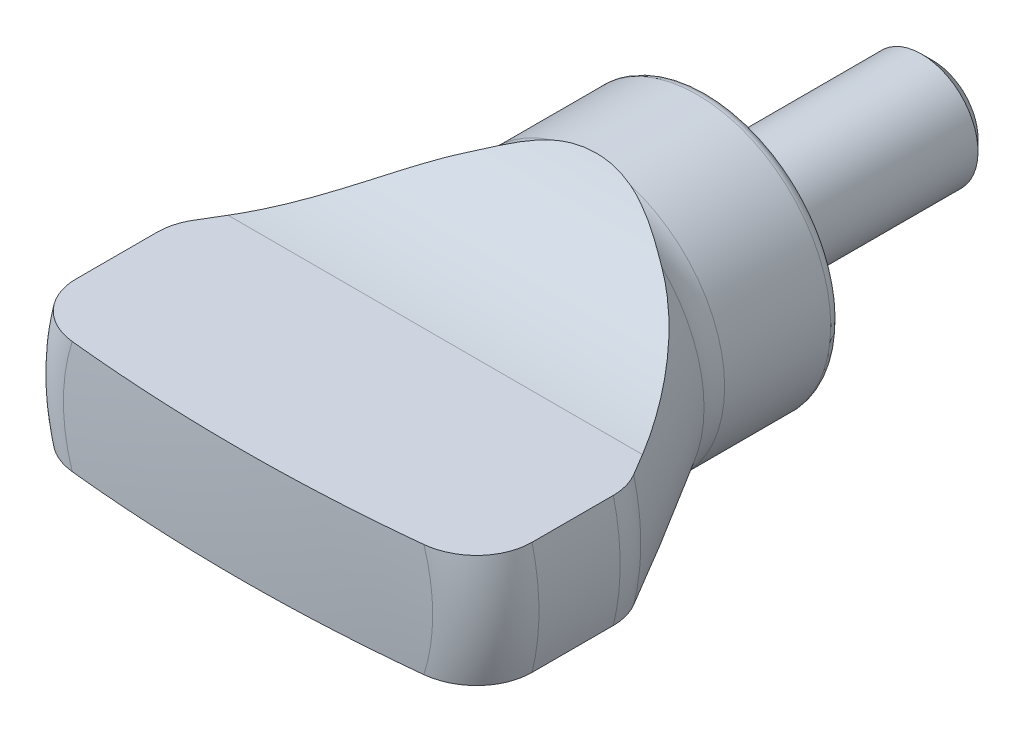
ISO-10303-21;
HEADER;
FILE_DESCRIPTION(('STEP AP214'),'2;1');
FILE_NAME('part.step','',(''),(''),'','','');
FILE_SCHEMA(('AUTOMOTIVE_DESIGN { 1 0 10303 214 1 1 1 1 }'));
ENDSEC;
DATA;
#1=APPLICATION_CONTEXT('core data for automotive mechanical design processes');
#2=APPLICATION_PROTOCOL_DEFINITION('international standard','automotive_design',2000,#1);
#3=PRODUCT_CONTEXT('',#1,'mechanical');
#4=PRODUCT('Part','Part','',(#3));
#5=PRODUCT_RELATED_PRODUCT_CATEGORY('part','',(#4));
#6=PRODUCT_DEFINITION_FORMATION('','',#4);
#7=PRODUCT_DEFINITION_CONTEXT('part definition',#1,'design');
#8=PRODUCT_DEFINITION('design','',#6,#7);
#9=PRODUCT_DEFINITION_SHAPE('','',#8);
#10=(LENGTH_UNIT() NAMED_UNIT(*) SI_UNIT(.MILLI.,.METRE.));
#11=(NAMED_UNIT(*) PLANE_ANGLE_UNIT() SI_UNIT($,.RADIAN.));
#12=(NAMED_UNIT(*) SI_UNIT($,.STERADIAN.) SOLID_ANGLE_UNIT());
#13=UNCERTAINTY_MEASURE_WITH_UNIT(LENGTH_MEASURE(1.E-05),#10,'distance_accuracy_value','');
#14=(GEOMETRIC_REPRESENTATION_CONTEXT(3) GLOBAL_UNCERTAINTY_ASSIGNED_CONTEXT((#13)) GLOBAL_UNIT_ASSIGNED_CONTEXT((#10,
#11,#12)) REPRESENTATION_CONTEXT('',''));
#15=CARTESIAN_POINT('',(0.,0.,0.));
#16=DIRECTION('',(0.,0.,1.));
#17=DIRECTION('',(1.,0.,0.));
#18=AXIS2_PLACEMENT_3D('',#15,#16,#17);
#19=CARTESIAN_POINT('',(0.,0.,-64.9999999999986));
#20=DIRECTION('',(0.,0.,-1.));
#21=DIRECTION('',(1.,0.,0.));
#22=AXIS2_PLACEMENT_3D('',#19,#20,#21);
#23=SPHERICAL_SURFACE('',#22,89.9999999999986);
#24=CARTESIAN_POINT('',(0.,0.,24.461827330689));
#25=DIRECTION('',(0.,0.,-1.));
#26=DIRECTION('',(0.,1.,0.));
#27=AXIS2_PLACEMENT_3D('',#24,#25,#26);
#28=CIRCLE('',#27,9.82758620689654);
#29=CARTESIAN_POINT('',(-9.35849617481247,-3.,24.461827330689));
#30=VERTEX_POINT('',#29);
#31=CARTESIAN_POINT('',(-9.35849617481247,3.,24.461827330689));
#32=VERTEX_POINT('',#31);
#33=EDGE_CURVE('E332',#30,#32,#28,.T.);
#34=ORIENTED_EDGE('',*,*,#33,.F.);
#35=CARTESIAN_POINT('',(0.,-3.,-64.9999999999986));
#36=DIRECTION('',(0.,-1.,0.));
#37=DIRECTION('',(1.,0.,0.));
#38=AXIS2_PLACEMENT_3D('',#35,#36,#37);
#39=CIRCLE('',#38,89.9499861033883);
#40=CARTESIAN_POINT('',(9.35849617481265,-3.,24.461827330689));
#41=VERTEX_POINT('',#40);
#42=EDGE_CURVE('E285',#30,#41,#39,.F.);
#43=ORIENTED_EDGE('',*,*,#42,.T.);
#44=CARTESIAN_POINT('',(9.35849617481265,3.,24.461827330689));
#45=VERTEX_POINT('',#44);
#46=EDGE_CURVE('E333',#45,#41,#28,.T.);
#47=ORIENTED_EDGE('',*,*,#46,.F.);
#48=CARTESIAN_POINT('',(0.,3.,-64.9999999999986));
#49=DIRECTION('',(0.,1.,0.));
#50=DIRECTION('',(-1.,0.,0.));
#51=AXIS2_PLACEMENT_3D('',#48,#49,#50);
#52=CIRCLE('',#51,89.9499861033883);
#53=EDGE_CURVE('E307',#45,#32,#52,.F.);
#54=ORIENTED_EDGE('',*,*,#53,.T.);
#55=EDGE_LOOP('',(#34,#43,#47,#54));
#56=FACE_BOUND('',#55,.T.);
#57=ADVANCED_FACE('F14',(#56),#23,.T.);
#58=CARTESIAN_POINT('',(0.,0.,21.479766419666));
#59=DIRECTION('',(0.,0.,-1.));
#60=DIRECTION('',(0.,1.,0.));
#61=AXIS2_PLACEMENT_3D('',#58,#59,#60);
#62=TOROIDAL_SURFACE('',#61,9.5,3.);
#63=CARTESIAN_POINT('',(0.,0.,21.479766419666));
#64=DIRECTION('',(0.,0.,-1.));
#65=DIRECTION('',(0.,1.,0.));
#66=AXIS2_PLACEMENT_3D('',#63,#64,#65);
#67=CIRCLE('',#66,12.5);
#68=CARTESIAN_POINT('',(-12.1346610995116,-3.,21.479766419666));
#69=VERTEX_POINT('',#68);
#70=CARTESIAN_POINT('',(-12.1346610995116,3.,21.479766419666));
#71=VERTEX_POINT('',#70);
#72=EDGE_CURVE('E329',#69,#71,#67,.T.);
#73=ORIENTED_EDGE('',*,*,#72,.F.);
#74=CARTESIAN_POINT('',(-11.7237759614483,-3.,22.9737759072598));
#75=CARTESIAN_POINT('',(-11.6368347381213,-3.,23.1204234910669));
#76=CARTESIAN_POINT('',(-11.5371404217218,-3.,23.2596903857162));
#77=CARTESIAN_POINT('',(-11.315494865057,-3.,23.5194421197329));
#78=CARTESIAN_POINT('',(-11.1935086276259,-3.,23.63989686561));
#79=CARTESIAN_POINT('',(-10.9314122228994,-3.,23.858559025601));
#80=CARTESIAN_POINT('',(-10.7913372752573,-3.,23.9568086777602));
#81=CARTESIAN_POINT('',(-10.4970909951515,-3.,24.1290589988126));
#82=CARTESIAN_POINT('',(-10.3429233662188,-3.,24.2030660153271));
#83=CARTESIAN_POINT('',(-10.0205079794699,-3.,24.3270766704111));
#84=CARTESIAN_POINT('',(-9.85199468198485,-3.,24.3763890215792));
#85=CARTESIAN_POINT('',(-9.50923380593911,-3.,24.4472793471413));
#86=CARTESIAN_POINT('',(-9.33498483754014,-3.,24.4688505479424));
#87=CARTESIAN_POINT('',(-8.97789494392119,-3.,24.4845747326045));
#88=CARTESIAN_POINT('',(-8.79500141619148,-3.,24.4775338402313));
#89=CARTESIAN_POINT('',(-8.43274799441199,-3.,24.4340125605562));
#90=CARTESIAN_POINT('',(-8.25338888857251,-3.,24.3975256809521));
#91=CARTESIAN_POINT('',(-7.89627744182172,-3.,24.294445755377));
#92=CARTESIAN_POINT('',(-7.71883309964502,-3.,24.2267832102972));
#93=CARTESIAN_POINT('',(-7.37760011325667,-3.,24.0628865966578));
#94=CARTESIAN_POINT('',(-7.2138147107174,-3.,23.9666457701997));
#95=CARTESIAN_POINT('',(-6.90360189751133,-3.,23.7469407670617));
#96=CARTESIAN_POINT('',(-6.75732706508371,-3.,23.6232608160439));
#97=CARTESIAN_POINT('',(-6.4889095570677,-3.,23.3517541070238));
#98=CARTESIAN_POINT('',(-6.3667622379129,-3.,23.203932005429));
#99=CARTESIAN_POINT('',(-6.20884449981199,-3.,22.9713467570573));
#100=CARTESIAN_POINT('',(-6.16142786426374,-3.,22.8942976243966));
#101=CARTESIAN_POINT('',(-6.07388663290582,-3.,22.7361794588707));
#102=CARTESIAN_POINT('',(-6.0337580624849,-3.,22.6551126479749));
#103=CARTESIAN_POINT('',(-5.96138485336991,-3.,22.4895902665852));
#104=CARTESIAN_POINT('',(-5.92913555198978,-3.,22.4051367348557));
#105=CARTESIAN_POINT('',(-5.87300865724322,-3.,22.2334905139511));
#106=CARTESIAN_POINT('',(-5.84913003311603,-3.,22.1462981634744));
#107=CARTESIAN_POINT('',(-5.81223458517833,-3.,21.9793283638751));
#108=CARTESIAN_POINT('',(-5.79833439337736,-3.,21.8997452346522));
#109=CARTESIAN_POINT('',(-5.77776594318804,-3.,21.7396194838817));
#110=CARTESIAN_POINT('',(-5.77110004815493,-3.,21.6590765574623));
#111=CARTESIAN_POINT('',(-5.76512077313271,-3.,21.4977738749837));
#112=CARTESIAN_POINT('',(-5.76580186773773,-3.,21.4170143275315));
#113=CARTESIAN_POINT('',(-5.77448254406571,-3.,21.2558809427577));
#114=CARTESIAN_POINT('',(-5.78248478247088,-3.,21.1755072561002));
#115=CARTESIAN_POINT('',(-5.8157343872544,-3.,20.9469387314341));
#116=CARTESIAN_POINT('',(-5.84989838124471,-3.,20.7999488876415));
#117=CARTESIAN_POINT('',(-5.94154886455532,-3.,20.5135512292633));
#118=CARTESIAN_POINT('',(-5.99903896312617,-3.,20.3741445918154));
#119=CARTESIAN_POINT('',(-6.13733979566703,-3.,20.1009705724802));
#120=CARTESIAN_POINT('',(-6.21893008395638,-3.,19.9675988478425));
#121=CARTESIAN_POINT('',(-6.40141213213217,-3.,19.7148233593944));
#122=CARTESIAN_POINT('',(-6.50231086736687,-3.,19.5954246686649));
#123=CARTESIAN_POINT('',(-6.73119663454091,-3.,19.3615097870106));
#124=CARTESIAN_POINT('',(-6.86087722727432,-3.,19.2486501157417));
#125=CARTESIAN_POINT('',(-7.13606730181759,-3.,19.0442370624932));
#126=CARTESIAN_POINT('',(-7.28158323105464,-3.,18.9526924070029));
#127=CARTESIAN_POINT('',(-7.59763163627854,-3.,18.7858480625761));
#128=CARTESIAN_POINT('',(-7.76923902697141,-3.,18.7125775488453));
#129=CARTESIAN_POINT('',(-8.12211390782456,-3.,18.5949559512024));
#130=CARTESIAN_POINT('',(-8.30338336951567,-3.,18.5506107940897));
#131=CARTESIAN_POINT('',(-8.67599551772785,-3.,18.4914412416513));
#132=CARTESIAN_POINT('',(-8.86747809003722,-3.,18.4774893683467));
#133=CARTESIAN_POINT('',(-9.25002035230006,-3.,18.482648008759));
#134=CARTESIAN_POINT('',(-9.44108007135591,-3.,18.5017561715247));
#135=CARTESIAN_POINT('',(-9.81297194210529,-3.,18.5724125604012));
#136=CARTESIAN_POINT('',(-9.99393463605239,-3.,18.6232708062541));
#137=CARTESIAN_POINT('',(-10.344133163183,-3.,18.7559809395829));
#138=CARTESIAN_POINT('',(-10.5133716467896,-3.,18.837825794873));
#139=CARTESIAN_POINT('',(-10.8276485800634,-3.,19.026500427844));
#140=CARTESIAN_POINT('',(-10.9734063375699,-3.,19.1321318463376));
#141=CARTESIAN_POINT('',(-11.2441341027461,-3.,19.3673359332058));
#142=CARTESIAN_POINT('',(-11.3691091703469,-3.,19.4969027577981));
#143=CARTESIAN_POINT('',(-11.5893099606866,-3.,19.770487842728));
#144=CARTESIAN_POINT('',(-11.6855491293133,-3.,19.9136908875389));
#145=CARTESIAN_POINT('',(-11.8517435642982,-3.,20.2146072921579));
#146=CARTESIAN_POINT('',(-11.9217049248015,-3.,20.3723172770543));
#147=CARTESIAN_POINT('',(-12.0312876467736,-3.,20.6926425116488));
#148=CARTESIAN_POINT('',(-12.0717577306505,-3.,20.8549678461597));
#149=CARTESIAN_POINT('',(-12.1244093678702,-3.,21.1841916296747));
#150=CARTESIAN_POINT('',(-12.1365859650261,-3.,21.3510908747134));
#151=CARTESIAN_POINT('',(-12.1322719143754,-3.,21.6820235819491));
#152=CARTESIAN_POINT('',(-12.1162017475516,-3.,21.8460629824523));
#153=CARTESIAN_POINT('',(-12.0567271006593,-3.,22.1689457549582));
#154=CARTESIAN_POINT('',(-12.0133604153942,-3.,22.3277959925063));
#155=CARTESIAN_POINT('',(-11.925917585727,-3.,22.5671796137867));
#156=CARTESIAN_POINT('',(-11.890762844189,-3.,22.6510787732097));
#157=CARTESIAN_POINT('',(-11.8128727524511,-3.,22.8152767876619));
#158=CARTESIAN_POINT('',(-11.7701375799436,-3.,22.8955757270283));
#159=CARTESIAN_POINT('',(-11.7237759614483,-3.,22.9737759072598));
#160=B_SPLINE_CURVE_WITH_KNOTS('',3,(#74,#75,#76,#77,#78,#79,#80,#81,#82,#83,#84,#85,#86,#87,
#88,#89,#90,#91,#92,#93,#94,#95,#96,#97,#98,#99,#100,#101,#102,#103,#104,#105,#106,#107,#108,
#109,#110,#111,#112,#113,#114,#115,#116,#117,#118,#119,#120,#121,#122,#123,#124,#125,#126,#127,
#128,#129,#130,#131,#132,#133,#134,#135,#136,#137,#138,#139,#140,#141,#142,#143,#144,#145,#146,
#147,#148,#149,#150,#151,#152,#153,#154,#155,#156,#157,#158,#159),.UNSPECIFIED.,.T.,.F.,(4,2,2,
2,2,2,2,2,2,2,2,2,2,2,2,2,2,2,2,2,2,2,2,2,2,2,2,2,2,2,2,2,2,2,2,2,2,2,2,2,2,2,4),(0.,
0.511102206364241,1.02301382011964,1.53394333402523,2.04473896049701,2.56912966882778,
3.09364839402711,3.64027333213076,4.18701882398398,4.75410408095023,5.3213235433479,
5.8931724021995,6.46491109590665,6.73601299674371,7.00696660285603,7.2777594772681,
7.5485189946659,7.79056318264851,8.03268641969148,8.27462757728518,8.51665656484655,
8.96712840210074,9.41766996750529,9.88477282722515,10.3520447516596,10.8656245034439,
11.3794141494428,11.936664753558,12.4940295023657,13.0671949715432,13.6403196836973,
14.2014033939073,14.7623598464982,15.2996748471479,15.8368588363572,16.3519133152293,
16.8668482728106,17.3663058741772,17.8658509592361,18.3580226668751,18.8495144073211,
19.1220672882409,19.3946137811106),.UNSPECIFIED.);
#161=EDGE_CURVE('E342',#69,#30,#160,.T.);
#162=ORIENTED_EDGE('',*,*,#161,.T.);
#163=ORIENTED_EDGE('',*,*,#33,.T.);
#164=CARTESIAN_POINT('',(-11.7237759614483,3.,22.9737759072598));
#165=CARTESIAN_POINT('',(-11.8077215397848,3.,22.8321504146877));
#166=CARTESIAN_POINT('',(-11.8799063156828,3.,22.6834265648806));
#167=CARTESIAN_POINT('',(-11.9983941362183,3.,22.3758725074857));
#168=CARTESIAN_POINT('',(-12.0446711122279,3.,22.217032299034));
#169=CARTESIAN_POINT('',(-12.1097847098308,3.,21.8938023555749));
#170=CARTESIAN_POINT('',(-12.1286211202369,3.,21.7294125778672));
#171=CARTESIAN_POINT('',(-12.1382275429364,3.,21.3998525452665));
#172=CARTESIAN_POINT('',(-12.1290037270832,3.,21.2346824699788));
#173=CARTESIAN_POINT('',(-12.0829469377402,3.,20.9092581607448));
#174=CARTESIAN_POINT('',(-12.0462801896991,3.,20.7489803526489));
#175=CARTESIAN_POINT('',(-11.9467009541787,3.,20.4368028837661));
#176=CARTESIAN_POINT('',(-11.8837876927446,3.,20.2849034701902));
#177=CARTESIAN_POINT('',(-11.7332642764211,3.,19.9928150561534));
#178=CARTESIAN_POINT('',(-11.6455181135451,3.,19.8526962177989));
#179=CARTESIAN_POINT('',(-11.4481782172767,3.,19.5888134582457));
#180=CARTESIAN_POINT('',(-11.338582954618,3.,19.4650506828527));
#181=CARTESIAN_POINT('',(-11.0984089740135,3.,19.2346565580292));
#182=CARTESIAN_POINT('',(-10.9674545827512,3.,19.1284171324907));
#183=CARTESIAN_POINT('',(-10.6900445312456,3.,18.9386227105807));
#184=CARTESIAN_POINT('',(-10.5435868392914,3.,18.8550706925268));
#185=CARTESIAN_POINT('',(-10.2342742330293,3.,18.7100368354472));
#186=CARTESIAN_POINT('',(-10.0710402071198,3.,18.6493641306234));
#187=CARTESIAN_POINT('',(-9.73694688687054,3.,18.5550869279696));
#188=CARTESIAN_POINT('',(-9.56608615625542,3.,18.5214875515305));
#189=CARTESIAN_POINT('',(-9.21411001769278,3.,18.4808401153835));
#190=CARTESIAN_POINT('',(-9.03286193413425,3.,18.474941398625));
#191=CARTESIAN_POINT('',(-8.67178419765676,3.,18.4924147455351));
#192=CARTESIAN_POINT('',(-8.49195486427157,3.,18.5157932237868));
#193=CARTESIAN_POINT('',(-8.13124489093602,3.,18.5923462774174));
#194=CARTESIAN_POINT('',(-7.95060761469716,3.,18.6466704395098));
#195=CARTESIAN_POINT('',(-7.6007052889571,3.,18.7843247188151));
#196=CARTESIAN_POINT('',(-7.43144297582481,3.,18.8676617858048));
#197=CARTESIAN_POINT('',(-7.1063043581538,3.,19.0630486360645));
#198=CARTESIAN_POINT('',(-6.95071102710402,3.,19.1755711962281));
#199=CARTESIAN_POINT('',(-6.6614696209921,3.,19.426033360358));
#200=CARTESIAN_POINT('',(-6.52782134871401,3.,19.5639727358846));
#201=CARTESIAN_POINT('',(-6.29243660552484,3.,19.8565895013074));
#202=CARTESIAN_POINT('',(-6.18969006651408,3.,20.0104436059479));
#203=CARTESIAN_POINT('',(-6.05859007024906,3.,20.2533915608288));
#204=CARTESIAN_POINT('',(-6.01871945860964,3.,20.3364247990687));
#205=CARTESIAN_POINT('',(-5.94721129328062,3.,20.5059457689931));
#206=CARTESIAN_POINT('',(-5.91556885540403,3.,20.5924314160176));
#207=CARTESIAN_POINT('',(-5.86375500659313,3.,20.7593965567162));
#208=CARTESIAN_POINT('',(-5.84275705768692,3.,20.8396207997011));
#209=CARTESIAN_POINT('',(-5.80819130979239,3.,21.0016177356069));
#210=CARTESIAN_POINT('',(-5.79461968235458,3.,21.0833896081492));
#211=CARTESIAN_POINT('',(-5.77511768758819,3.,21.2478207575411));
#212=CARTESIAN_POINT('',(-5.76918495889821,3.,21.3304797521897));
#213=CARTESIAN_POINT('',(-5.76504164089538,3.,21.4959660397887));
#214=CARTESIAN_POINT('',(-5.76683064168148,3.,21.5787933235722));
#215=CARTESIAN_POINT('',(-5.78281130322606,3.,21.8122865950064));
#216=CARTESIAN_POINT('',(-5.80603339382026,3.,21.9624293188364));
#217=CARTESIAN_POINT('',(-5.87703382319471,3.,22.2566737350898));
#218=CARTESIAN_POINT('',(-5.92481436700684,3.,22.4007748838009));
#219=CARTESIAN_POINT('',(-6.04346486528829,3.,22.6814797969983));
#220=CARTESIAN_POINT('',(-6.11464880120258,3.,22.8179503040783));
#221=CARTESIAN_POINT('',(-6.27704022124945,3.,23.0783675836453));
#222=CARTESIAN_POINT('',(-6.36825410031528,3.,23.2023103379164));
#223=CARTESIAN_POINT('',(-6.5769924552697,3.,23.4463341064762));
#224=CARTESIAN_POINT('',(-6.69616877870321,3.,23.5650014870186));
#225=CARTESIAN_POINT('',(-6.95124002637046,3.,23.7827476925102));
#226=CARTESIAN_POINT('',(-7.08714204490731,3.,23.8818181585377));
#227=CARTESIAN_POINT('',(-7.38547927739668,3.,24.0668749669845));
#228=CARTESIAN_POINT('',(-7.54920681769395,3.,24.1507836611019));
#229=CARTESIAN_POINT('',(-7.88803145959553,3.,24.2912125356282));
#230=CARTESIAN_POINT('',(-8.06313154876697,3.,24.3477254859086));
#231=CARTESIAN_POINT('',(-8.42762134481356,3.,24.4335588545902));
#232=CARTESIAN_POINT('',(-8.61730247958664,3.,24.461650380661));
#233=CARTESIAN_POINT('',(-8.99869568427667,3.,24.485178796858));
#234=CARTESIAN_POINT('',(-9.19040764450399,3.,24.4806174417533));
#235=CARTESIAN_POINT('',(-9.56779063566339,3.,24.4385959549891));
#236=CARTESIAN_POINT('',(-9.75350725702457,3.,24.401548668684));
#237=CARTESIAN_POINT('',(-10.1156519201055,3.,24.2954781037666));
#238=CARTESIAN_POINT('',(-10.2920794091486,3.,24.2264529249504));
#239=CARTESIAN_POINT('',(-10.6230709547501,3.,24.0612417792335));
#240=CARTESIAN_POINT('',(-10.7782219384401,3.,23.9662305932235));
#241=CARTESIAN_POINT('',(-11.0692594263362,3.,23.7504802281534));
#242=CARTESIAN_POINT('',(-11.2051757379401,3.,23.6297815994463));
#243=CARTESIAN_POINT('',(-11.404236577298,3.,23.4181818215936));
#244=CARTESIAN_POINT('',(-11.4749541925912,3.,23.3342770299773));
#245=CARTESIAN_POINT('',(-11.6067775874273,3.,23.1592222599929));
#246=CARTESIAN_POINT('',(-11.6678836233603,3.,23.0680724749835));
#247=CARTESIAN_POINT('',(-11.7237759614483,3.,22.9737759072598));
#248=B_SPLINE_CURVE_WITH_KNOTS('',3,(#164,#165,#166,#167,#168,#169,#170,#171,#172,#173,#174,
#175,#176,#177,#178,#179,#180,#181,#182,#183,#184,#185,#186,#187,#188,#189,#190,#191,#192,#193,
#194,#195,#196,#197,#198,#199,#200,#201,#202,#203,#204,#205,#206,#207,#208,#209,#210,#211,#212,
#213,#214,#215,#216,#217,#218,#219,#220,#221,#222,#223,#224,#225,#226,#227,#228,#229,#230,#231,
#232,#233,#234,#235,#236,#237,#238,#239,#240,#241,#242,#243,#244,#245,#246,#247),.UNSPECIFIED.,
.T.,.F.,(4,2,2,2,2,2,2,2,2,2,2,2,2,2,2,2,2,2,2,2,2,2,2,2,2,2,2,2,2,2,2,2,2,2,2,2,2,2,2,2,2,4),
(0.,0.493510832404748,0.987517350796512,1.48152767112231,1.97542934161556,2.4663633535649,
2.95731184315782,3.45100306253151,3.9447288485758,4.44832446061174,4.95198615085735,
5.47208277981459,5.99227777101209,6.53387633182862,7.07559357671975,7.6388854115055,
8.20231227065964,8.77550798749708,9.34869855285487,9.90035993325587,10.1763317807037,
10.4521394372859,10.7005872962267,10.9489069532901,11.1971498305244,11.4453795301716,
11.8988158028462,12.3522927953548,12.8121204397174,13.2720951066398,13.7745476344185,
14.2772140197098,14.8266915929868,15.3763141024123,15.948798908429,16.5212529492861,
17.086535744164,17.6518521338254,18.1949385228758,18.7371738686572,19.0657702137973,
19.3943577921),.UNSPECIFIED.);
#249=EDGE_CURVE('E301',#32,#71,#248,.T.);
#250=ORIENTED_EDGE('',*,*,#249,.T.);
#251=EDGE_LOOP('',(#73,#162,#163,#250));
#252=FACE_BOUND('',#251,.T.);
#253=ADVANCED_FACE('F287',(#252),#62,.T.);
#254=CARTESIAN_POINT('',(12.1346610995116,3.,21.479766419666));
#255=VERTEX_POINT('',#254);
#256=CARTESIAN_POINT('',(12.1346610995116,-3.,21.479766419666));
#257=VERTEX_POINT('',#256);
#258=EDGE_CURVE('E330',#255,#257,#67,.T.);
#259=ORIENTED_EDGE('',*,*,#258,.F.);
#260=CARTESIAN_POINT('',(6.04374007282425,3.,22.6726382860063));
#261=CARTESIAN_POINT('',(5.97702609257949,3.,22.534735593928));
#262=CARTESIAN_POINT('',(5.92127288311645,3.,22.3914729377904));
#263=CARTESIAN_POINT('',(5.83430220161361,3.,22.0976296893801));
#264=CARTESIAN_POINT('',(5.80308540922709,3.,21.9470488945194));
#265=CARTESIAN_POINT('',(5.76684993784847,3.,21.642473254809));
#266=CARTESIAN_POINT('',(5.76187630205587,3.,21.4884729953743));
#267=CARTESIAN_POINT('',(5.77854271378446,3.,21.1819360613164));
#268=CARTESIAN_POINT('',(5.80018200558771,3.,21.0293993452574));
#269=CARTESIAN_POINT('',(5.8681152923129,3.,20.7333774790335));
#270=CARTESIAN_POINT('',(5.91387805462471,3.,20.5897691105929));
#271=CARTESIAN_POINT('',(6.02754093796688,3.,20.3116281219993));
#272=CARTESIAN_POINT('',(6.09544665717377,3.,20.1770978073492));
#273=CARTESIAN_POINT('',(6.25529394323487,3.,19.9122646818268));
#274=CARTESIAN_POINT('',(6.34841373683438,3.,19.7826752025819));
#275=CARTESIAN_POINT('',(6.55319457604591,3.,19.5391085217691));
#276=CARTESIAN_POINT('',(6.66486281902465,3.,19.4251374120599));
#277=CARTESIAN_POINT('',(6.91578388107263,3.,19.2039247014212));
#278=CARTESIAN_POINT('',(7.05668842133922,3.,19.0985545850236));
#279=CARTESIAN_POINT('',(7.35319204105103,3.,18.9110349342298));
#280=CARTESIAN_POINT('',(7.508796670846,3.,18.8288942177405));
#281=CARTESIAN_POINT('',(7.84256388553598,3.,18.6844445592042));
#282=CARTESIAN_POINT('',(8.02154400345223,3.,18.6240166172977));
#283=CARTESIAN_POINT('',(8.38704994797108,3.,18.5335601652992));
#284=CARTESIAN_POINT('',(8.5735767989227,3.,18.503535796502));
#285=CARTESIAN_POINT('',(8.95176937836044,3.,18.4749094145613));
#286=CARTESIAN_POINT('',(9.14347043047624,3.,18.4767658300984));
#287=CARTESIAN_POINT('',(9.52368184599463,3.,18.513623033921));
#288=CARTESIAN_POINT('',(9.71219259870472,3.,18.5486197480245));
#289=CARTESIAN_POINT('',(10.0747826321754,3.,18.6499384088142));
#290=CARTESIAN_POINT('',(10.2491209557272,3.,18.7153312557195));
#291=CARTESIAN_POINT('',(10.5835935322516,3.,18.8757639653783));
#292=CARTESIAN_POINT('',(10.7437312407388,3.,18.9707965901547));
#293=CARTESIAN_POINT('',(11.0378069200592,3.,19.1833514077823));
#294=CARTESIAN_POINT('',(11.1725809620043,3.,19.2997169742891));
#295=CARTESIAN_POINT('',(11.4196825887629,3.,19.5542490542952));
#296=CARTESIAN_POINT('',(11.5320154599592,3.,19.6924104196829));
#297=CARTESIAN_POINT('',(11.7264684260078,3.,19.9807350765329));
#298=CARTESIAN_POINT('',(11.8095978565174,3.,20.130218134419));
#299=CARTESIAN_POINT('',(11.9487889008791,3.,20.4412963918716));
#300=CARTESIAN_POINT('',(12.004855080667,3.,20.6028895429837));
#301=CARTESIAN_POINT('',(12.0869123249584,3.,20.9289638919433));
#302=CARTESIAN_POINT('',(12.1136627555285,3.,21.0932543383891));
#303=CARTESIAN_POINT('',(12.1388436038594,3.,21.4239867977));
#304=CARTESIAN_POINT('',(12.1372765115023,3.,21.5904286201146));
#305=CARTESIAN_POINT('',(12.1060619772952,3.,21.9186944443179));
#306=CARTESIAN_POINT('',(12.076740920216,3.,22.0805496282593));
#307=CARTESIAN_POINT('',(11.991432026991,3.,22.3970632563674));
#308=CARTESIAN_POINT('',(11.9354444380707,3.,22.5517217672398));
#309=CARTESIAN_POINT('',(11.7983216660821,3.,22.85011377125));
#310=CARTESIAN_POINT('',(11.717097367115,3.,22.9938062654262));
#311=CARTESIAN_POINT('',(11.5320823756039,3.,23.2658272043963));
#312=CARTESIAN_POINT('',(11.4282903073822,3.,23.3941547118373));
#313=CARTESIAN_POINT('',(11.1991773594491,3.,23.6343792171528));
#314=CARTESIAN_POINT('',(11.0735005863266,3.,23.7459365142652));
#315=CARTESIAN_POINT('',(10.8056878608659,3.,23.9471158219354));
#316=CARTESIAN_POINT('',(10.6635498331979,3.,24.0367350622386));
#317=CARTESIAN_POINT('',(10.3621869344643,3.,24.1945486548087));
#318=CARTESIAN_POINT('',(10.2025682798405,3.,24.2619904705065));
#319=CARTESIAN_POINT('',(9.87456382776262,3.,24.3702766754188));
#320=CARTESIAN_POINT('',(9.70617642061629,3.,24.4111161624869));
#321=CARTESIAN_POINT('',(9.3581769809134,3.,24.4668105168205));
#322=CARTESIAN_POINT('',(9.17838633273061,3.,24.4805486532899));
#323=CARTESIAN_POINT('',(8.81894839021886,3.,24.4789147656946));
#324=CARTESIAN_POINT('',(8.63930112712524,3.,24.4635375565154));
#325=CARTESIAN_POINT('',(8.27746929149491,3.,24.4032841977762));
#326=CARTESIAN_POINT('',(8.09548055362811,3.,24.3572293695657));
#327=CARTESIAN_POINT('',(7.74143216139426,3.,24.2359018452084));
#328=CARTESIAN_POINT('',(7.56937730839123,3.,24.1606151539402));
#329=CARTESIAN_POINT('',(7.23628162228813,3.,23.9806837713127));
#330=CARTESIAN_POINT('',(7.0755781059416,3.,23.8754133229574));
#331=CARTESIAN_POINT('',(6.77484148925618,3.,23.6387361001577));
#332=CARTESIAN_POINT('',(6.63478585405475,3.,23.5073581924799));
#333=CARTESIAN_POINT('',(6.41516827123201,3.,23.2603781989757));
#334=CARTESIAN_POINT('',(6.32950057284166,3.,23.1501573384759));
#335=CARTESIAN_POINT('',(6.17411840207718,3.,22.9189783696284));
#336=CARTESIAN_POINT('',(6.10439858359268,3.,22.7980238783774));
#337=CARTESIAN_POINT('',(6.04374007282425,3.,22.6726382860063));
#338=B_SPLINE_CURVE_WITH_KNOTS('',3,(#260,#261,#262,#263,#264,#265,#266,#267,#268,#269,#270,
#271,#272,#273,#274,#275,#276,#277,#278,#279,#280,#281,#282,#283,#284,#285,#286,#287,#288,#289,
#290,#291,#292,#293,#294,#295,#296,#297,#298,#299,#300,#301,#302,#303,#304,#305,#306,#307,#308,
#309,#310,#311,#312,#313,#314,#315,#316,#317,#318,#319,#320,#321,#322,#323,#324,#325,#326,#327,
#328,#329,#330,#331,#332,#333,#334,#335,#336,#337),.UNSPECIFIED.,.T.,.F.,(4,2,2,2,2,2,2,2,2,2,2,
2,2,2,2,2,2,2,2,2,2,2,2,2,2,2,2,2,2,2,2,2,2,2,2,2,2,2,4),(0.,0.459126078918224,0.91826487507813,
1.37819147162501,1.83810500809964,2.28828946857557,2.73858783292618,3.21535529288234,
3.69230818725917,4.2178994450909,4.74368995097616,5.30778966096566,5.87196619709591,
6.44426199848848,7.01648745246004,7.5722687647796,8.12791446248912,8.65941659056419,
9.19079336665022,9.70139946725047,10.2119193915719,10.7088776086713,11.2057921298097,
11.6969346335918,12.1880725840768,12.6809649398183,13.1738873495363,13.675737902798,
14.1776517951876,14.695166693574,15.2127769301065,15.7513038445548,16.2899266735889,
16.8505390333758,17.4114201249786,17.9849926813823,18.5579345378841,18.9755270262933,
19.3929793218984),.UNSPECIFIED.);
#339=EDGE_CURVE('E294',#255,#45,#338,.T.);
#340=ORIENTED_EDGE('',*,*,#339,.T.);
#341=ORIENTED_EDGE('',*,*,#46,.T.);
#342=CARTESIAN_POINT('',(6.04374007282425,-3.,22.6726382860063));
#343=CARTESIAN_POINT('',(6.1201842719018,-3.,22.8306235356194));
#344=CARTESIAN_POINT('',(6.21114510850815,-3.,22.981811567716));
#345=CARTESIAN_POINT('',(6.41770692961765,-3.,23.2665895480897));
#346=CARTESIAN_POINT('',(6.53337133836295,-3.,23.4001327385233));
#347=CARTESIAN_POINT('',(6.7843299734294,-3.,23.6460325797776));
#348=CARTESIAN_POINT('',(6.91953578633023,-3.,23.7584796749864));
#349=CARTESIAN_POINT('',(7.20579569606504,-3.,23.9607066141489));
#350=CARTESIAN_POINT('',(7.3568426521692,-3.,24.0504966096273));
#351=CARTESIAN_POINT('',(7.68130525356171,-3.,24.2108456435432));
#352=CARTESIAN_POINT('',(7.8555384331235,-3.,24.2797548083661));
#353=CARTESIAN_POINT('',(8.21297516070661,-3.,24.3881530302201));
#354=CARTESIAN_POINT('',(8.39618139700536,-3.,24.4276332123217));
#355=CARTESIAN_POINT('',(8.77105700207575,-3.,24.4763660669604));
#356=CARTESIAN_POINT('',(8.96282400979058,-3.,24.4848759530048));
#357=CARTESIAN_POINT('',(9.34498203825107,-3.,24.4687611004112));
#358=CARTESIAN_POINT('',(9.53537319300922,-3.,24.4441396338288));
#359=CARTESIAN_POINT('',(9.90442228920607,-3.,24.3627753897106));
#360=CARTESIAN_POINT('',(10.0832518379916,-3.,24.3068135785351));
#361=CARTESIAN_POINT('',(10.428308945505,-3.,24.1643307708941));
#362=CARTESIAN_POINT('',(10.5945395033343,-3.,24.0778170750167));
#363=CARTESIAN_POINT('',(10.9020540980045,-3.,23.880654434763));
#364=CARTESIAN_POINT('',(11.0441006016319,-3.,23.7711947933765));
#365=CARTESIAN_POINT('',(11.3068084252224,-3.,23.5290606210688));
#366=CARTESIAN_POINT('',(11.427474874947,-3.,23.3963916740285));
#367=CARTESIAN_POINT('',(11.6388674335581,-3.,23.1174604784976));
#368=CARTESIAN_POINT('',(11.7306089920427,-3.,22.9719673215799));
#369=CARTESIAN_POINT('',(11.8875179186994,-3.,22.6672935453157));
#370=CARTESIAN_POINT('',(11.9526901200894,-3.,22.5081154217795));
#371=CARTESIAN_POINT('',(12.052776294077,-3.,22.1855487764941));
#372=CARTESIAN_POINT('',(12.0885074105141,-3.,22.0224134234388));
#373=CARTESIAN_POINT('',(12.1316420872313,-3.,21.6924434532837));
#374=CARTESIAN_POINT('',(12.1390484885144,-3.,21.5256092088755));
#375=CARTESIAN_POINT('',(12.1253910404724,-3.,21.1954659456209));
#376=CARTESIAN_POINT('',(12.1047249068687,-3.,21.0321402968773));
#377=CARTESIAN_POINT('',(12.036291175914,-3.,20.7112778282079));
#378=CARTESIAN_POINT('',(11.9885241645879,-3.,20.5537408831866));
#379=CARTESIAN_POINT('',(11.8673330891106,-3.,20.2486597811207));
#380=CARTESIAN_POINT('',(11.7938782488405,-3.,20.1011278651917));
#381=CARTESIAN_POINT('',(11.6236111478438,-3.,19.8202367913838));
#382=CARTESIAN_POINT('',(11.5267976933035,-3.,19.6868783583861));
#383=CARTESIAN_POINT('',(11.3110245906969,-3.,19.4357637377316));
#384=CARTESIAN_POINT('',(11.1917374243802,-3.,19.3182892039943));
#385=CARTESIAN_POINT('',(10.9356252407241,-3.,19.1043591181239));
#386=CARTESIAN_POINT('',(10.7987982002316,-3.,19.007905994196));
#387=CARTESIAN_POINT('',(10.5072845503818,-3.,18.8356635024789));
#388=CARTESIAN_POINT('',(10.3521930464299,-3.,18.7605599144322));
#389=CARTESIAN_POINT('',(10.0319413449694,-3.,18.6363524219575));
#390=CARTESIAN_POINT('',(9.8667794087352,-3.,18.5872530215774));
#391=CARTESIAN_POINT('',(9.52417023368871,-3.,18.5143595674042));
#392=CARTESIAN_POINT('',(9.34649528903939,-3.,18.491636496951));
#393=CARTESIAN_POINT('',(8.98981012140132,-3.,18.4750550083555));
#394=CARTESIAN_POINT('',(8.81079962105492,-3.,18.4812027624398));
#395=CARTESIAN_POINT('',(8.4485839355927,-3.,18.5225870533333));
#396=CARTESIAN_POINT('',(8.26551601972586,-3.,18.5590283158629));
#397=CARTESIAN_POINT('',(7.90775291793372,-3.,18.6612772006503));
#398=CARTESIAN_POINT('',(7.73305969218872,-3.,18.7270916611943));
#399=CARTESIAN_POINT('',(7.39219513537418,-3.,18.8885420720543));
#400=CARTESIAN_POINT('',(7.22638086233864,-3.,18.9849346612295));
#401=CARTESIAN_POINT('',(6.9135951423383,-3.,19.2046286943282));
#402=CARTESIAN_POINT('',(6.7666266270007,-3.,19.3279343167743));
#403=CARTESIAN_POINT('',(6.4992245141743,-3.,19.5963634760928));
#404=CARTESIAN_POINT('',(6.37835585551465,-3.,19.741048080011));
#405=CARTESIAN_POINT('',(6.21864013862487,-3.,19.9727009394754));
#406=CARTESIAN_POINT('',(6.16898645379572,-3.,20.0523853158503));
#407=CARTESIAN_POINT('',(6.07750583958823,-3.,20.2161080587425));
#408=CARTESIAN_POINT('',(6.03567434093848,-3.,20.3001438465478));
#409=CARTESIAN_POINT('',(5.96367052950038,-3.,20.4646191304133));
#410=CARTESIAN_POINT('',(5.93280981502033,-3.,20.5447580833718));
#411=CARTESIAN_POINT('',(5.87863033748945,-3.,20.7075071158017));
#412=CARTESIAN_POINT('',(5.85530754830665,-3.,20.7901158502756));
#413=CARTESIAN_POINT('',(5.81656236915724,-3.,20.9571601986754));
#414=CARTESIAN_POINT('',(5.80113860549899,-3.,21.0415954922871));
#415=CARTESIAN_POINT('',(5.77844324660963,-3.,21.2115266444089));
#416=CARTESIAN_POINT('',(5.77117075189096,-3.,21.2970223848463));
#417=CARTESIAN_POINT('',(5.76244812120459,-3.,21.5366352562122));
#418=CARTESIAN_POINT('',(5.77024571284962,-3.,21.691183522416));
#419=CARTESIAN_POINT('',(5.81226815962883,-3.,21.9963826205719));
#420=CARTESIAN_POINT('',(5.84645399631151,-3.,22.1470388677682));
#421=CARTESIAN_POINT('',(5.9133473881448,-3.,22.358569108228));
#422=CARTESIAN_POINT('',(5.93626082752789,-3.,22.4226865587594));
#423=CARTESIAN_POINT('',(5.98663595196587,-3.,22.5490891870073));
#424=CARTESIAN_POINT('',(6.01409655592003,-3.,22.6113747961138));
#425=CARTESIAN_POINT('',(6.04374007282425,-3.,22.6726382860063));
#426=B_SPLINE_CURVE_WITH_KNOTS('',3,(#342,#343,#344,#345,#346,#347,#348,#349,#350,#351,#352,
#353,#354,#355,#356,#357,#358,#359,#360,#361,#362,#363,#364,#365,#366,#367,#368,#369,#370,#371,
#372,#373,#374,#375,#376,#377,#378,#379,#380,#381,#382,#383,#384,#385,#386,#387,#388,#389,#390,
#391,#392,#393,#394,#395,#396,#397,#398,#399,#400,#401,#402,#403,#404,#405,#406,#407,#408,#409,
#410,#411,#412,#413,#414,#415,#416,#417,#418,#419,#420,#421,#422,#423,#424,#425),.UNSPECIFIED.,
.T.,.F.,(4,2,2,2,2,2,2,2,2,2,2,2,2,2,2,2,2,2,2,2,2,2,2,2,2,2,2,2,2,2,2,2,2,2,2,2,2,2,2,2,2,4),
(0.,0.526250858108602,1.05386941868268,1.57917149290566,2.10423778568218,2.66378100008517,
3.22349288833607,3.7965435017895,4.36953752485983,4.92885070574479,5.48803032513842,
6.02331544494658,6.55847195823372,7.07193369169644,7.58530197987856,8.08388984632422,
8.58242770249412,9.07397572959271,9.56551312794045,10.0576414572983,10.5497949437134,
11.0497702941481,11.5498033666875,12.0644404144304,12.5791665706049,13.1141329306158,
13.6492136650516,14.2066524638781,14.764221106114,15.3368321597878,15.9095321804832,
16.4717872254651,16.7531029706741,17.0342538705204,17.2915314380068,17.5486713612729,
17.805766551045,18.0628333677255,18.5246016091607,18.9856883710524,19.1898062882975,
19.3938757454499),.UNSPECIFIED.);
#427=EDGE_CURVE('E279',#41,#257,#426,.T.);
#428=ORIENTED_EDGE('',*,*,#427,.T.);
#429=EDGE_LOOP('',(#259,#340,#341,#428));
#430=FACE_BOUND('',#429,.T.);
#431=ADVANCED_FACE('F290',(#430),#62,.T.);
#432=CARTESIAN_POINT('',(0.,0.,0.));
#433=DIRECTION('',(0.,0.,-1.));
#434=DIRECTION('',(0.,1.,0.));
#435=AXIS2_PLACEMENT_3D('',#432,#433,#434);
#436=CYLINDRICAL_SURFACE('',#435,12.5);
#437=DIRECTION('',(0.,0.,-1.));
#438=VECTOR('',#437,1.);
#439=CARTESIAN_POINT('',(-12.1346610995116,-3.,0.));
#440=LINE('',#439,#438);
#441=CARTESIAN_POINT('',(-12.1346610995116,-3.,17.1569219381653));
#442=VERTEX_POINT('',#441);
#443=EDGE_CURVE('E392',#69,#442,#440,.T.);
#444=ORIENTED_EDGE('',*,*,#443,.F.);
#445=ORIENTED_EDGE('',*,*,#72,.T.);
#446=DIRECTION('',(0.,0.,-1.));
#447=VECTOR('',#446,1.);
#448=CARTESIAN_POINT('',(-12.1346610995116,3.,0.));
#449=LINE('',#448,#447);
#450=CARTESIAN_POINT('',(-12.1346610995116,3.,17.1569219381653));
#451=VERTEX_POINT('',#450);
#452=EDGE_CURVE('E306',#451,#71,#449,.F.);
#453=ORIENTED_EDGE('',*,*,#452,.F.);
#454=CARTESIAN_POINT('',(0.,0.,17.1569219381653));
#455=DIRECTION('',(0.,0.,-1.));
#456=DIRECTION('',(0.,1.,0.));
#457=AXIS2_PLACEMENT_3D('',#454,#455,#456);
#458=CIRCLE('',#457,12.5);
#459=EDGE_CURVE('E316',#442,#451,#458,.T.);
#460=ORIENTED_EDGE('',*,*,#459,.F.);
#461=EDGE_LOOP('',(#444,#445,#453,#460));
#462=FACE_BOUND('',#461,.T.);
#463=ADVANCED_FACE('F259',(#462),#436,.T.);
#464=DIRECTION('',(0.,0.,-1.));
#465=VECTOR('',#464,1.);
#466=CARTESIAN_POINT('',(12.1346610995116,3.,0.));
#467=LINE('',#466,#465);
#468=CARTESIAN_POINT('',(12.1346610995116,3.,17.1569219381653));
#469=VERTEX_POINT('',#468);
#470=EDGE_CURVE('E250',#255,#469,#467,.T.);
#471=ORIENTED_EDGE('',*,*,#470,.F.);
#472=ORIENTED_EDGE('',*,*,#258,.T.);
#473=DIRECTION('',(0.,0.,-1.));
#474=VECTOR('',#473,1.);
#475=CARTESIAN_POINT('',(12.1346610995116,-3.,0.));
#476=LINE('',#475,#474);
#477=CARTESIAN_POINT('',(12.1346610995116,-3.,17.1569219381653));
#478=VERTEX_POINT('',#477);
#479=EDGE_CURVE('E277',#478,#257,#476,.F.);
#480=ORIENTED_EDGE('',*,*,#479,.F.);
#481=EDGE_CURVE('E326',#469,#478,#458,.T.);
#482=ORIENTED_EDGE('',*,*,#481,.F.);
#483=EDGE_LOOP('',(#471,#472,#480,#482));
#484=FACE_BOUND('',#483,.T.);
#485=ADVANCED_FACE('F257',(#484),#436,.T.);
#486=CARTESIAN_POINT('',(0.,0.,17.1569219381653));
#487=DIRECTION('',(0.,0.,-1.));
#488=DIRECTION('',(0.,1.,0.));
#489=AXIS2_PLACEMENT_3D('',#486,#487,#488);
#490=TOROIDAL_SURFACE('',#489,9.5,3.);
#491=CARTESIAN_POINT('',(0.,0.,15.6569219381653));
#492=DIRECTION('',(0.,0.,-1.));
#493=DIRECTION('',(0.,1.,0.));
#494=AXIS2_PLACEMENT_3D('',#491,#492,#493);
#495=CIRCLE('',#494,12.0980762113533);
#496=CARTESIAN_POINT('',(-11.7202153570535,-3.,15.6569219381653));
#497=VERTEX_POINT('',#496);
#498=CARTESIAN_POINT('',(-11.7202153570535,3.,15.6569219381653));
#499=VERTEX_POINT('',#498);
#500=EDGE_CURVE('E314',#497,#499,#495,.T.);
#501=ORIENTED_EDGE('',*,*,#500,.F.);
#502=CARTESIAN_POINT('',(-12.0118046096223,-3.,16.3195642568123));
#503=CARTESIAN_POINT('',(-12.0588235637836,-3.,16.4765292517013));
#504=CARTESIAN_POINT('',(-12.0926692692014,-3.,16.637564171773));
#505=CARTESIAN_POINT('',(-12.1328414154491,-3.,16.963161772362));
#506=CARTESIAN_POINT('',(-12.139136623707,-3.,17.127728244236));
#507=CARTESIAN_POINT('',(-12.1239523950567,-3.,17.4555129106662));
#508=CARTESIAN_POINT('',(-12.102485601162,-3.,17.618731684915));
#509=CARTESIAN_POINT('',(-12.0324907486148,-3.,17.9392091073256));
#510=CARTESIAN_POINT('',(-11.9839687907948,-3.,18.0964690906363));
#511=CARTESIAN_POINT('',(-11.8613136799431,-3.,18.4009380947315));
#512=CARTESIAN_POINT('',(-11.7871404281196,-3.,18.5481309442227));
#513=CARTESIAN_POINT('',(-11.6155048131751,-3.,18.8282371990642));
#514=CARTESIAN_POINT('',(-11.5180405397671,-3.,18.9611494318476));
#515=CARTESIAN_POINT('',(-11.301022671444,-3.,19.2112928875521));
#516=CARTESIAN_POINT('',(-11.1811390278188,-3.,19.3282375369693));
#517=CARTESIAN_POINT('',(-10.9239311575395,-3.,19.5410217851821));
#518=CARTESIAN_POINT('',(-10.7866049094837,-3.,19.6368589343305));
#519=CARTESIAN_POINT('',(-10.4941621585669,-3.,19.8077994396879));
#520=CARTESIAN_POINT('',(-10.3386414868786,-3.,19.8822108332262));
#521=CARTESIAN_POINT('',(-10.0176499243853,-3.,20.0049766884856));
#522=CARTESIAN_POINT('',(-9.85217733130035,-3.,20.0533266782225));
#523=CARTESIAN_POINT('',(-9.50904178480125,-3.,20.1246582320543));
#524=CARTESIAN_POINT('',(-9.33115542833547,-3.,20.1465643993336));
#525=CARTESIAN_POINT('',(-8.97418101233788,-3.,20.1614873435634));
#526=CARTESIAN_POINT('',(-8.79509270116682,-3.,20.1544978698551));
#527=CARTESIAN_POINT('',(-8.43286657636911,-3.,20.1113888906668));
#528=CARTESIAN_POINT('',(-8.24987157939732,-3.,20.074066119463));
#529=CARTESIAN_POINT('',(-7.89240122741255,-3.,19.9700661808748));
#530=CARTESIAN_POINT('',(-7.71792785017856,-3.,19.9033822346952));
#531=CARTESIAN_POINT('',(-7.37773041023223,-3.,19.7402282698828));
#532=CARTESIAN_POINT('',(-7.21236202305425,-3.,19.6430138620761));
#533=CARTESIAN_POINT('',(-6.90062252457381,-3.,19.4217400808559));
#534=CARTESIAN_POINT('',(-6.7542542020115,-3.,19.2976767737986));
#535=CARTESIAN_POINT('',(-6.48833072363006,-3.,19.0279548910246));
#536=CARTESIAN_POINT('',(-6.36831546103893,-3.,18.8827557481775));
#537=CARTESIAN_POINT('',(-6.20995866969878,-3.,18.6504403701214));
#538=CARTESIAN_POINT('',(-6.16077048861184,-3.,18.5705515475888));
#539=CARTESIAN_POINT('',(-6.07024646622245,-3.,18.4064610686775));
#540=CARTESIAN_POINT('',(-6.02890603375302,-3.,18.3222619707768));
#541=CARTESIAN_POINT('',(-5.95788984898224,-3.,18.1575802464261));
#542=CARTESIAN_POINT('',(-5.92751838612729,-3.,18.0773967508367));
#543=CARTESIAN_POINT('',(-5.87431882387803,-3.,17.9146024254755));
#544=CARTESIAN_POINT('',(-5.85148670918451,-3.,17.831992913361));
#545=CARTESIAN_POINT('',(-5.81372166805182,-3.,17.6650275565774));
#546=CARTESIAN_POINT('',(-5.79878481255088,-3.,17.5806726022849));
#547=CARTESIAN_POINT('',(-5.77704878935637,-3.,17.4109233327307));
#548=CARTESIAN_POINT('',(-5.77024892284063,-3.,17.3255291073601));
#549=CARTESIAN_POINT('',(-5.76517806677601,-3.,17.1631356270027));
#550=CARTESIAN_POINT('',(-5.76611415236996,-3.,17.0861606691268));
#551=CARTESIAN_POINT('',(-5.77463379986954,-3.,16.932572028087));
#552=CARTESIAN_POINT('',(-5.78221960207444,-3.,16.8559584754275));
#553=CARTESIAN_POINT('',(-5.81482791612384,-3.,16.6275885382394));
#554=CARTESIAN_POINT('',(-5.84969613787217,-3.,16.4771254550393));
#555=CARTESIAN_POINT('',(-5.94304486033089,-3.,16.1866479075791));
#556=CARTESIAN_POINT('',(-6.0011215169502,-3.,16.0465009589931));
#557=CARTESIAN_POINT('',(-6.1383107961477,-3.,15.7769221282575));
#558=CARTESIAN_POINT('',(-6.21742898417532,-3.,15.6474930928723));
#559=CARTESIAN_POINT('',(-6.40077724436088,-3.,15.3921809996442));
#560=CARTESIAN_POINT('',(-6.50648406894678,-3.,15.2673608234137));
#561=CARTESIAN_POINT('',(-6.73560085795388,-3.,15.0352036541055));
#562=CARTESIAN_POINT('',(-6.85901824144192,-3.,14.9278740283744));
#563=CARTESIAN_POINT('',(-7.13336251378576,-3.,14.7226922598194));
#564=CARTESIAN_POINT('',(-7.28580650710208,-3.,14.6268647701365));
#565=CARTESIAN_POINT('',(-7.60392996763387,-3.,14.4604898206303));
#566=CARTESIAN_POINT('',(-7.76961379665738,-3.,14.3899507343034));
#567=CARTESIAN_POINT('',(-8.11997566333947,-3.,14.2724735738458));
#568=CARTESIAN_POINT('',(-8.30519793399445,-3.,14.227150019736));
#569=CARTESIAN_POINT('',(-8.68064277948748,-3.,14.1681972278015));
#570=CARTESIAN_POINT('',(-8.87086566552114,-3.,14.154569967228));
#571=CARTESIAN_POINT('',(-9.25098968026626,-3.,14.1599385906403));
#572=CARTESIAN_POINT('',(-9.44089058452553,-3.,14.1789517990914));
#573=CARTESIAN_POINT('',(-9.81448698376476,-3.,14.2497803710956));
#574=CARTESIAN_POINT('',(-9.99818377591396,-3.,14.3015888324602));
#575=CARTESIAN_POINT('',(-10.3471555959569,-3.,14.4347307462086));
#576=CARTESIAN_POINT('',(-10.5128516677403,-3.,14.5149594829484));
#577=CARTESIAN_POINT('',(-10.8276061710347,-3.,14.7033468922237));
#578=CARTESIAN_POINT('',(-10.9766642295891,-3.,14.8115061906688));
#579=CARTESIAN_POINT('',(-11.2469908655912,-3.,15.0475852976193));
#580=CARTESIAN_POINT('',(-11.3691806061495,-3.,15.174451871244));
#581=CARTESIAN_POINT('',(-11.589408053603,-3.,15.44746694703));
#582=CARTESIAN_POINT('',(-11.6874830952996,-3.,15.5935850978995));
#583=CARTESIAN_POINT('',(-11.8217600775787,-3.,15.8379492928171));
#584=CARTESIAN_POINT('',(-11.8668804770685,-3.,15.9314045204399));
#585=CARTESIAN_POINT('',(-11.947026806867,-3.,16.1225514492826));
#586=CARTESIAN_POINT('',(-11.982052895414,-3.,16.2202430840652));
#587=CARTESIAN_POINT('',(-12.0118046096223,-3.,16.3195642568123));
#588=B_SPLINE_CURVE_WITH_KNOTS('',3,(#502,#503,#504,#505,#506,#507,#508,#509,#510,#511,#512,
#513,#514,#515,#516,#517,#518,#519,#520,#521,#522,#523,#524,#525,#526,#527,#528,#529,#530,#531,
#532,#533,#534,#535,#536,#537,#538,#539,#540,#541,#542,#543,#544,#545,#546,#547,#548,#549,#550,
#551,#552,#553,#554,#555,#556,#557,#558,#559,#560,#561,#562,#563,#564,#565,#566,#567,#568,#569,
#570,#571,#572,#573,#574,#575,#576,#577,#578,#579,#580,#581,#582,#583,#584,#585,#586,#587),
.UNSPECIFIED.,.T.,.F.,(4,2,2,2,2,2,2,2,2,2,2,2,2,2,2,2,2,2,2,2,2,2,2,2,2,2,2,2,2,2,2,2,2,2,2,2,
2,2,2,2,2,2,4),(0.,0.491189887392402,0.982936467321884,1.47445918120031,1.96587110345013,
2.45805471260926,2.95027870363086,3.45041904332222,3.95061739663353,4.46551307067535,
4.98049706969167,5.51578598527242,6.0511906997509,6.60893486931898,7.16680787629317,
7.73950462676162,8.31228534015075,8.8740888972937,9.15519018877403,9.43612651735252,
9.69300672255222,9.94974989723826,10.2063651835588,10.462958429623,10.6936044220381,
10.9243281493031,11.3852501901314,11.8384786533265,12.2918271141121,12.7805147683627,
13.269407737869,13.8072469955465,14.345264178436,14.914627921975,15.484027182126,
16.0537287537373,16.6233104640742,17.1728215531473,17.7223449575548,18.2481718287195,
18.7731794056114,19.0839895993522,19.3947949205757),.UNSPECIFIED.);
#589=EDGE_CURVE('E374',#497,#442,#588,.T.);
#590=ORIENTED_EDGE('',*,*,#589,.T.);
#591=ORIENTED_EDGE('',*,*,#459,.T.);
#592=CARTESIAN_POINT('',(-12.0118046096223,3.,16.3195642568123));
#593=CARTESIAN_POINT('',(-11.9638403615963,3.,16.1595002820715));
#594=CARTESIAN_POINT('',(-11.9020981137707,3.,16.0034147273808));
#595=CARTESIAN_POINT('',(-11.7530379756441,3.,15.7038001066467));
#596=CARTESIAN_POINT('',(-11.6656829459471,3.,15.5602896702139));
#597=CARTESIAN_POINT('',(-11.4683502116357,3.,15.2901115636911));
#598=CARTESIAN_POINT('',(-11.358407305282,3.,15.1634184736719));
#599=CARTESIAN_POINT('',(-11.1192231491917,3.,14.9299073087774));
#600=CARTESIAN_POINT('',(-10.9899867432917,3.,14.8230842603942));
#601=CARTESIAN_POINT('',(-10.7132680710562,3.,14.6298723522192));
#602=CARTESIAN_POINT('',(-10.565477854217,3.,14.5439250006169));
#603=CARTESIAN_POINT('',(-10.257959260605,3.,14.3970408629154));
#604=CARTESIAN_POINT('',(-10.0982285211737,3.,14.3361090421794));
#605=CARTESIAN_POINT('',(-9.76500560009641,3.,14.2385054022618));
#606=CARTESIAN_POINT('',(-9.59122196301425,3.,14.2028293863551));
#607=CARTESIAN_POINT('',(-9.24018886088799,3.,14.1598751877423));
#608=CARTESIAN_POINT('',(-9.06293868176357,3.,14.1526029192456));
#609=CARTESIAN_POINT('',(-8.70203297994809,3.,14.1664122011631));
#610=CARTESIAN_POINT('',(-8.51842363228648,3.,14.1887060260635));
#611=CARTESIAN_POINT('',(-8.15724137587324,3.,14.2627722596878));
#612=CARTESIAN_POINT('',(-7.9796698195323,3.,14.3145512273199));
#613=CARTESIAN_POINT('',(-7.62955541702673,3.,14.4482721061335));
#614=CARTESIAN_POINT('',(-7.45736687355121,3.,14.5311449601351));
#615=CARTESIAN_POINT('',(-7.12935499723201,3.,14.7246966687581));
#616=CARTESIAN_POINT('',(-6.97353522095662,3.,14.8353815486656));
#617=CARTESIAN_POINT('',(-6.68396234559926,3.,15.0816515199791));
#618=CARTESIAN_POINT('',(-6.5501106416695,3.,15.2171192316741));
#619=CARTESIAN_POINT('',(-6.36944478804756,3.,15.4366270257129));
#620=CARTESIAN_POINT('',(-6.31255322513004,3.,15.5125527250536));
#621=CARTESIAN_POINT('',(-6.20613226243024,3.,15.6693805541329));
#622=CARTESIAN_POINT('',(-6.156598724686,3.,15.7502798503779));
#623=CARTESIAN_POINT('',(-6.06876648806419,3.,15.9106556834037));
#624=CARTESIAN_POINT('',(-6.02992383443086,3.,15.9898348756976));
#625=CARTESIAN_POINT('',(-5.95973963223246,3.,16.1514117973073));
#626=CARTESIAN_POINT('',(-5.92839406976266,3.,16.2338077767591));
#627=CARTESIAN_POINT('',(-5.87367972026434,3.,16.4011570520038));
#628=CARTESIAN_POINT('',(-5.85030615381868,3.,16.4861087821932));
#629=CARTESIAN_POINT('',(-5.8119070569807,3.,16.6578777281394));
#630=CARTESIAN_POINT('',(-5.79688061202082,3.,16.7446947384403));
#631=CARTESIAN_POINT('',(-5.77659328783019,3.,16.9100187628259));
#632=CARTESIAN_POINT('',(-5.7704586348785,3.,16.9884195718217));
#633=CARTESIAN_POINT('',(-5.76514609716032,3.,17.1454839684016));
#634=CARTESIAN_POINT('',(-5.76597045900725,3.,17.2241476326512));
#635=CARTESIAN_POINT('',(-5.77457042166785,3.,17.3810526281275));
#636=CARTESIAN_POINT('',(-5.78234209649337,3.,17.459294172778));
#637=CARTESIAN_POINT('',(-5.80470730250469,3.,17.6148050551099));
#638=CARTESIAN_POINT('',(-5.81930339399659,3.,17.6920740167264));
#639=CARTESIAN_POINT('',(-5.8714778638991,3.,17.914819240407));
#640=CARTESIAN_POINT('',(-5.91788027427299,3.,18.0583207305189));
#641=CARTESIAN_POINT('',(-6.03275529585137,3.,18.3360738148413));
#642=CARTESIAN_POINT('',(-6.10123260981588,3.,18.4703234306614));
#643=CARTESIAN_POINT('',(-6.26227354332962,3.,18.7346722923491));
#644=CARTESIAN_POINT('',(-6.35603382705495,3.,18.8640417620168));
#645=CARTESIAN_POINT('',(-6.56205396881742,3.,19.107069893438));
#646=CARTESIAN_POINT('',(-6.67432120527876,3.,19.220722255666));
#647=CARTESIAN_POINT('',(-6.92645331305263,3.,19.4411760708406));
#648=CARTESIAN_POINT('',(-7.0679651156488,3.,19.5460962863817));
#649=CARTESIAN_POINT('',(-7.36561470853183,3.,19.7326094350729));
#650=CARTESIAN_POINT('',(-7.52175797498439,3.,19.8141935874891));
#651=CARTESIAN_POINT('',(-7.85644274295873,3.,19.9573327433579));
#652=CARTESIAN_POINT('',(-8.03578745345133,3.,20.0170177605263));
#653=CARTESIAN_POINT('',(-8.40189852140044,3.,20.1059137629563));
#654=CARTESIAN_POINT('',(-8.58866584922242,3.,20.1351207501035));
#655=CARTESIAN_POINT('',(-8.96706109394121,3.,20.1620290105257));
#656=CARTESIAN_POINT('',(-9.15872055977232,3.,20.1592949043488));
#657=CARTESIAN_POINT('',(-9.53869540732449,3.,20.1206890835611));
#658=CARTESIAN_POINT('',(-9.72701119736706,3.,20.0848214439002));
#659=CARTESIAN_POINT('',(-10.0889929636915,3.,19.9818389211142));
#660=CARTESIAN_POINT('',(-10.2629258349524,3.,19.9156641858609));
#661=CARTESIAN_POINT('',(-10.5964556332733,3.,19.7537498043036));
#662=CARTESIAN_POINT('',(-10.7560560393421,3.,19.6580173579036));
#663=CARTESIAN_POINT('',(-11.0489636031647,3.,19.4442014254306));
#664=CARTESIAN_POINT('',(-11.1831121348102,3.,19.327270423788));
#665=CARTESIAN_POINT('',(-11.4288708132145,3.,19.0717332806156));
#666=CARTESIAN_POINT('',(-11.5404872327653,3.,18.9331331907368));
#667=CARTESIAN_POINT('',(-11.7334792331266,3.,18.6440829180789));
#668=CARTESIAN_POINT('',(-11.8158659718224,3.,18.494307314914));
#669=CARTESIAN_POINT('',(-11.9535601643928,3.,18.1827306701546));
#670=CARTESIAN_POINT('',(-12.0088645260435,3.,18.0209282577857));
#671=CARTESIAN_POINT('',(-12.0894327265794,3.,17.6944769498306));
#672=CARTESIAN_POINT('',(-12.1154361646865,3.,17.5300097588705));
#673=CARTESIAN_POINT('',(-12.1390572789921,3.,17.1992064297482));
#674=CARTESIAN_POINT('',(-12.1367158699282,3.,17.0328733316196));
#675=CARTESIAN_POINT('',(-12.1110517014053,3.,16.7751817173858));
#676=CARTESIAN_POINT('',(-12.0973264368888,3.,16.6827673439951));
#677=CARTESIAN_POINT('',(-12.0611027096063,3.,16.4996760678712));
#678=CARTESIAN_POINT('',(-12.0386043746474,3.,16.4089991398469));
#679=CARTESIAN_POINT('',(-12.0118046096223,3.,16.3195642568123));
#680=B_SPLINE_CURVE_WITH_KNOTS('',3,(#592,#593,#594,#595,#596,#597,#598,#599,#600,#601,#602,
#603,#604,#605,#606,#607,#608,#609,#610,#611,#612,#613,#614,#615,#616,#617,#618,#619,#620,#621,
#622,#623,#624,#625,#626,#627,#628,#629,#630,#631,#632,#633,#634,#635,#636,#637,#638,#639,#640,
#641,#642,#643,#644,#645,#646,#647,#648,#649,#650,#651,#652,#653,#654,#655,#656,#657,#658,#659,
#660,#661,#662,#663,#664,#665,#666,#667,#668,#669,#670,#671,#672,#673,#674,#675,#676,#677,#678,
#679),.UNSPECIFIED.,.T.,.F.,(4,2,2,2,2,2,2,2,2,2,2,2,2,2,2,2,2,2,2,2,2,2,2,2,2,2,2,2,2,2,2,2,2,
2,2,2,2,2,2,2,2,2,2,4),(0.,0.500936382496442,1.00260276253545,1.50350200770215,2.00427570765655,
2.51486377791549,3.02555314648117,3.55539988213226,4.08535693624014,4.63772926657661,
5.19022451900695,5.76078598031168,6.3314711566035,6.89952024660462,7.18380677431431,
7.46793281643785,7.73215480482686,7.99623501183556,8.26015661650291,8.52404929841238,
8.7596693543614,8.9953654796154,9.23092849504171,9.46657995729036,9.91685952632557,
10.3672350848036,10.8445765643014,11.3221088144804,11.8483494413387,12.3747878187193,
12.9392118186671,13.5037098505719,14.0759112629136,14.6480423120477,15.203516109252,
15.7588547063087,16.290053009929,16.8211032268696,17.3314046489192,17.8417643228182,
18.3389310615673,18.8353802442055,19.1152798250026,19.3951753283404),.UNSPECIFIED.);
#681=EDGE_CURVE('E265',#451,#499,#680,.T.);
#682=ORIENTED_EDGE('',*,*,#681,.T.);
#683=EDGE_LOOP('',(#501,#590,#591,#682));
#684=FACE_BOUND('',#683,.T.);
#685=ADVANCED_FACE('F252',(#684),#490,.T.);
#686=CARTESIAN_POINT('',(11.7202153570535,3.,15.6569219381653));
#687=VERTEX_POINT('',#686);
#688=CARTESIAN_POINT('',(11.7202153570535,-3.,15.6569219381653));
#689=VERTEX_POINT('',#688);
#690=EDGE_CURVE('E320',#687,#689,#495,.T.);
#691=ORIENTED_EDGE('',*,*,#690,.F.);
#692=CARTESIAN_POINT('',(5.84676977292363,3.,16.5058195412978));
#693=CARTESIAN_POINT('',(5.86688878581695,3.,16.4253126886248));
#694=CARTESIAN_POINT('',(5.89067960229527,3.,16.3457160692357));
#695=CARTESIAN_POINT('',(5.94524838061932,3.,16.188943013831));
#696=CARTESIAN_POINT('',(5.97602976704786,3.,16.1117677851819));
#697=CARTESIAN_POINT('',(6.07839022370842,3.,15.8844313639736));
#698=CARTESIAN_POINT('',(6.15994015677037,3.,15.7386372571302));
#699=CARTESIAN_POINT('',(6.34528783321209,3.,15.4632112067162));
#700=CARTESIAN_POINT('',(6.44897644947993,3.,15.3335047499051));
#701=CARTESIAN_POINT('',(6.6751480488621,3.,15.0918022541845));
#702=CARTESIAN_POINT('',(6.79762581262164,3.,14.9798013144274));
#703=CARTESIAN_POINT('',(7.06786468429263,3.,14.7675869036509));
#704=CARTESIAN_POINT('',(7.21684105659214,3.,14.6689212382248));
#705=CARTESIAN_POINT('',(7.52846686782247,3.,14.4962056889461));
#706=CARTESIAN_POINT('',(7.69112167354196,3.,14.4221655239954));
#707=CARTESIAN_POINT('',(8.036723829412,3.,14.2964855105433));
#708=CARTESIAN_POINT('',(8.22030375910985,3.,14.2465767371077));
#709=CARTESIAN_POINT('',(8.59324425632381,3.,14.1781082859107));
#710=CARTESIAN_POINT('',(8.78260535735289,3.,14.1595515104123));
#711=CARTESIAN_POINT('',(9.1626118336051,3.,14.1548032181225));
#712=CARTESIAN_POINT('',(9.35325918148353,3.,14.168755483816));
#713=CARTESIAN_POINT('',(9.72924096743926,3.,14.2296089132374));
#714=CARTESIAN_POINT('',(9.91457627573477,3.,14.2765046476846));
#715=CARTESIAN_POINT('',(10.2679535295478,3.,14.4004149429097));
#716=CARTESIAN_POINT('',(10.4363665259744,3.,14.4763698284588));
#717=CARTESIAN_POINT('',(10.7572164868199,3.,14.6567284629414));
#718=CARTESIAN_POINT('',(10.9096573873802,3.,14.7611251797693));
#719=CARTESIAN_POINT('',(11.1871285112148,3.,14.990455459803));
#720=CARTESIAN_POINT('',(11.3130654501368,3.,15.1142922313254));
#721=CARTESIAN_POINT('',(11.5413731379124,3.,15.3820659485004));
#722=CARTESIAN_POINT('',(11.6437492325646,3.,15.5259983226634));
#723=CARTESIAN_POINT('',(11.818095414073,3.,15.8240615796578));
#724=CARTESIAN_POINT('',(11.8910540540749,3.,15.9776147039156));
#725=CARTESIAN_POINT('',(12.0094343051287,3.,16.294991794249));
#726=CARTESIAN_POINT('',(12.0548601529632,3.,16.4588141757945));
#727=CARTESIAN_POINT('',(12.1159043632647,3.,16.7878583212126));
#728=CARTESIAN_POINT('',(12.1322093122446,3.,16.9529530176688));
#729=CARTESIAN_POINT('',(12.1365988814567,3.,17.2835116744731));
#730=CARTESIAN_POINT('',(12.1246855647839,3.,17.4489756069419));
#731=CARTESIAN_POINT('',(12.073260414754,3.,17.7740504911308));
#732=CARTESIAN_POINT('',(12.033992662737,3.,17.9337001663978));
#733=CARTESIAN_POINT('',(11.929373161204,3.,18.2442004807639));
#734=CARTESIAN_POINT('',(11.864021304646,3.,18.3950510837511));
#735=CARTESIAN_POINT('',(11.7087839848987,3.,18.6847662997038));
#736=CARTESIAN_POINT('',(11.6187462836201,3.,18.823549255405));
#737=CARTESIAN_POINT('',(11.417088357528,3.,19.0844143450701));
#738=CARTESIAN_POINT('',(11.3054665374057,3.,19.206495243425));
#739=CARTESIAN_POINT('',(11.0614378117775,3.,19.4332774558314));
#740=CARTESIAN_POINT('',(10.9286492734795,3.,19.5375677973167));
#741=CARTESIAN_POINT('',(10.647919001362,3.,19.7232058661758));
#742=CARTESIAN_POINT('',(10.4999752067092,3.,19.8045504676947));
#743=CARTESIAN_POINT('',(10.1879429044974,3.,19.9449409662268));
#744=CARTESIAN_POINT('',(10.023481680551,3.,20.0031578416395));
#745=CARTESIAN_POINT('',(9.68734666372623,3.,20.0923649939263));
#746=CARTESIAN_POINT('',(9.51567151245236,3.,20.1233501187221));
#747=CARTESIAN_POINT('',(9.16242433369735,3.,20.1585717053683));
#748=CARTESIAN_POINT('',(8.98073670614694,3.,20.1616484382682));
#749=CARTESIAN_POINT('',(8.61924053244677,3.,20.1384840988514));
#750=CARTESIAN_POINT('',(8.43943241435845,3.,20.1122364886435));
#751=CARTESIAN_POINT('',(8.07932581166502,3.,20.0298581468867));
#752=CARTESIAN_POINT('',(7.89928631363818,3.,19.9725924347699));
#753=CARTESIAN_POINT('',(7.55107972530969,3.,19.8291394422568));
#754=CARTESIAN_POINT('',(7.38291549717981,3.,19.7429452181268));
#755=CARTESIAN_POINT('',(7.06081783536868,3.,19.5421106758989));
#756=CARTESIAN_POINT('',(6.90714519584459,3.,19.4270503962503));
#757=CARTESIAN_POINT('',(6.62225650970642,3.,19.171806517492));
#758=CARTESIAN_POINT('',(6.49103847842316,3.,19.0316251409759));
#759=CARTESIAN_POINT('',(6.26135240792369,3.,18.7355045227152));
#760=CARTESIAN_POINT('',(6.16176155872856,3.,18.580447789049));
#761=CARTESIAN_POINT('',(6.03556462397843,3.,18.3361303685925));
#762=CARTESIAN_POINT('',(5.99735619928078,3.,18.2527100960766));
#763=CARTESIAN_POINT('',(5.92919978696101,3.,18.082535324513));
#764=CARTESIAN_POINT('',(5.89925056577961,3.,17.9957813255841));
#765=CARTESIAN_POINT('',(5.85072205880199,3.,17.828605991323));
#766=CARTESIAN_POINT('',(5.83130106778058,3.,17.748427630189));
#767=CARTESIAN_POINT('',(5.79985797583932,3.,17.5866350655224));
#768=CARTESIAN_POINT('',(5.78783497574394,3.,17.5050210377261));
#769=CARTESIAN_POINT('',(5.77139567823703,3.,17.3411790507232));
#770=CARTESIAN_POINT('',(5.76696570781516,3.,17.2589524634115));
#771=CARTESIAN_POINT('',(5.76574407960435,3.,17.094475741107));
#772=CARTESIAN_POINT('',(5.76894902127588,3.,17.0122256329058));
#773=CARTESIAN_POINT('',(5.78204918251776,3.,16.8587542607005));
#774=CARTESIAN_POINT('',(5.79104623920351,3.,16.7874547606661));
#775=CARTESIAN_POINT('',(5.81470311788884,3.,16.6458163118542));
#776=CARTESIAN_POINT('',(5.82936201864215,3.,16.5754772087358));
#777=CARTESIAN_POINT('',(5.84676977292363,3.,16.5058195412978));
#778=B_SPLINE_CURVE_WITH_KNOTS('',3,(#692,#693,#694,#695,#696,#697,#698,#699,#700,#701,#702,
#703,#704,#705,#706,#707,#708,#709,#710,#711,#712,#713,#714,#715,#716,#717,#718,#719,#720,#721,
#722,#723,#724,#725,#726,#727,#728,#729,#730,#731,#732,#733,#734,#735,#736,#737,#738,#739,#740,
#741,#742,#743,#744,#745,#746,#747,#748,#749,#750,#751,#752,#753,#754,#755,#756,#757,#758,#759,
#760,#761,#762,#763,#764,#765,#766,#767,#768,#769,#770,#771,#772,#773,#774,#775,#776,#777),
.UNSPECIFIED.,.T.,.F.,(4,2,2,2,2,2,2,2,2,2,2,2,2,2,2,2,2,2,2,2,2,2,2,2,2,2,2,2,2,2,2,2,2,2,2,2,
2,2,2,2,2,2,4),(0.,0.248869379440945,0.497860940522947,0.996387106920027,1.4925104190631,
1.98849616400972,2.52226353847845,3.05624132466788,3.62429626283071,4.19240378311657,
4.76302872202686,5.33355964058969,5.88501095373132,6.43632604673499,6.9635492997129,
7.49065281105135,7.99816838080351,8.50560583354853,9.00091304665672,9.49618404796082,
9.98709146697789,10.4780009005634,10.9720086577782,11.4660529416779,11.9702998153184,
12.4746153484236,12.9956567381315,13.5167966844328,14.0594980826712,14.6023205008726,
15.166497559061,15.7308101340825,16.303864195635,16.8768675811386,17.4263612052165,
17.7012665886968,17.9761308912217,18.223293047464,18.4704251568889,18.7171117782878,
18.9636885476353,19.179055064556,19.3943865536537),.UNSPECIFIED.);
#779=EDGE_CURVE('E124',#687,#469,#778,.T.);
#780=ORIENTED_EDGE('',*,*,#779,.T.);
#781=ORIENTED_EDGE('',*,*,#481,.T.);
#782=CARTESIAN_POINT('',(5.84676977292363,-3.,16.5058195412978));
#783=CARTESIAN_POINT('',(5.81001110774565,-3.,16.6529490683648));
#784=CARTESIAN_POINT('',(5.78551829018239,-3.,16.8032256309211));
#785=CARTESIAN_POINT('',(5.76245250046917,-3.,17.1058176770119));
#786=CARTESIAN_POINT('',(5.76389190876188,-3.,17.2581340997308));
#787=CARTESIAN_POINT('',(5.79261252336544,-3.,17.5601663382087));
#788=CARTESIAN_POINT('',(5.81987210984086,-3.,17.7098842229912));
#789=CARTESIAN_POINT('',(5.89873487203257,-3.,18.0027280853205));
#790=CARTESIAN_POINT('',(5.95034175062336,-3.,18.145853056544));
#791=CARTESIAN_POINT('',(6.07656654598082,-3.,18.424482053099));
#792=CARTESIAN_POINT('',(6.15156475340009,-3.,18.5598127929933));
#793=CARTESIAN_POINT('',(6.32130494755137,-3.,18.8174311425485));
#794=CARTESIAN_POINT('',(6.41605307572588,-3.,18.939714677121));
#795=CARTESIAN_POINT('',(6.63218515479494,-3.,19.1801443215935));
#796=CARTESIAN_POINT('',(6.75524863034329,-3.,19.2967802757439));
#797=CARTESIAN_POINT('',(7.01778127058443,-3.,19.5098369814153));
#798=CARTESIAN_POINT('',(7.15725739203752,-3.,19.6062491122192));
#799=CARTESIAN_POINT('',(7.46226304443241,-3.,19.7848474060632));
#800=CARTESIAN_POINT('',(7.62900785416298,-3.,19.8649643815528));
#801=CARTESIAN_POINT('',(7.97326213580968,-3.,19.9972294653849));
#802=CARTESIAN_POINT('',(8.15077419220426,-3.,20.049370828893));
#803=CARTESIAN_POINT('',(8.51857601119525,-3.,20.1255437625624));
#804=CARTESIAN_POINT('',(8.70909563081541,-3.,20.1484740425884));
#805=CARTESIAN_POINT('',(9.09127726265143,-3.,20.1614945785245));
#806=CARTESIAN_POINT('',(9.28293923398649,-3.,20.151586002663));
#807=CARTESIAN_POINT('',(9.65865927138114,-3.,20.0989692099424));
#808=CARTESIAN_POINT('',(9.8427895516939,-3.,20.0567799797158));
#809=CARTESIAN_POINT('',(10.2008167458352,-3.,19.9407633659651));
#810=CARTESIAN_POINT('',(10.3747158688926,-3.,19.8669428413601));
#811=CARTESIAN_POINT('',(10.699696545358,-3.,19.6929433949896));
#812=CARTESIAN_POINT('',(10.8514196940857,-3.,19.5939632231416));
#813=CARTESIAN_POINT('',(11.1351304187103,-3.,19.3708871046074));
#814=CARTESIAN_POINT('',(11.2671229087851,-3.,19.2467974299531));
#815=CARTESIAN_POINT('',(11.5017459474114,-3.,18.9827245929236));
#816=CARTESIAN_POINT('',(11.6053803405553,-3.,18.843632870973));
#817=CARTESIAN_POINT('',(11.7869163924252,-3.,18.5495607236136));
#818=CARTESIAN_POINT('',(11.8648231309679,-3.,18.3945834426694));
#819=CARTESIAN_POINT('',(11.9902054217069,-3.,18.078484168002));
#820=CARTESIAN_POINT('',(12.0385701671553,-3.,17.9177144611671));
#821=CARTESIAN_POINT('',(12.107087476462,-3.,17.5902743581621));
#822=CARTESIAN_POINT('',(12.127243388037,-3.,17.4236046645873));
#823=CARTESIAN_POINT('',(12.1385772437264,-3.,17.0921977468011));
#824=CARTESIAN_POINT('',(12.1302530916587,-3.,16.9274773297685));
#825=CARTESIAN_POINT('',(12.0859975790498,-3.,16.6017954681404));
#826=CARTESIAN_POINT('',(12.0500672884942,-3.,16.4408338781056));
#827=CARTESIAN_POINT('',(11.9518603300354,-3.,16.1275541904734));
#828=CARTESIAN_POINT('',(11.8896406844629,-3.,15.9752181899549));
#829=CARTESIAN_POINT('',(11.7408177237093,-3.,15.6829761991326));
#830=CARTESIAN_POINT('',(11.654213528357,-3.,15.5430706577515));
#831=CARTESIAN_POINT('',(11.4580204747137,-3.,15.2776722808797));
#832=CARTESIAN_POINT('',(11.3481534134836,-3.,15.1523852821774));
#833=CARTESIAN_POINT('',(11.1094318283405,-3.,14.9214608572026));
#834=CARTESIAN_POINT('',(10.9805753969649,-3.,14.8158254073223));
#835=CARTESIAN_POINT('',(10.7039663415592,-3.,14.6241303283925));
#836=CARTESIAN_POINT('',(10.5558042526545,-3.,14.5386619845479));
#837=CARTESIAN_POINT('',(10.2476303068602,-3.,14.392793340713));
#838=CARTESIAN_POINT('',(10.0876165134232,-3.,14.332397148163));
#839=CARTESIAN_POINT('',(9.75390617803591,-3.,14.235922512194));
#840=CARTESIAN_POINT('',(9.57992152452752,-3.,14.2008413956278));
#841=CARTESIAN_POINT('',(9.2285848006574,-3.,14.159101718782));
#842=CARTESIAN_POINT('',(9.05123204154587,-3.,14.1524490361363));
#843=CARTESIAN_POINT('',(8.69021613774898,-3.,14.1675337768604));
#844=CARTESIAN_POINT('',(8.50660348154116,-3.,14.1904842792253));
#845=CARTESIAN_POINT('',(8.14552677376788,-3.,14.2658641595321));
#846=CARTESIAN_POINT('',(7.96806391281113,-3.,14.3182992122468));
#847=CARTESIAN_POINT('',(7.61834917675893,-3.,14.453306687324));
#848=CARTESIAN_POINT('',(7.44645150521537,-3.,14.5367990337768));
#849=CARTESIAN_POINT('',(7.11906458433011,-3.,14.7316088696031));
#850=CARTESIAN_POINT('',(6.96358332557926,-3.,14.8429398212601));
#851=CARTESIAN_POINT('',(6.67489991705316,-3.,15.0903205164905));
#852=CARTESIAN_POINT('',(6.54159817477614,-3.,15.2262537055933));
#853=CARTESIAN_POINT('',(6.30194373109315,-3.,15.5199291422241));
#854=CARTESIAN_POINT('',(6.19553928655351,-3.,15.6776285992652));
#855=CARTESIAN_POINT('',(6.04868587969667,-3.,15.94837763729));
#856=CARTESIAN_POINT('',(5.99842953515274,-3.,16.056195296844));
#857=CARTESIAN_POINT('',(5.911866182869,-3.,16.277305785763));
#858=CARTESIAN_POINT('',(5.8755566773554,-3.,16.3905976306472));
#859=CARTESIAN_POINT('',(5.84676977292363,-3.,16.5058195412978));
#860=B_SPLINE_CURVE_WITH_KNOTS('',3,(#782,#783,#784,#785,#786,#787,#788,#789,#790,#791,#792,
#793,#794,#795,#796,#797,#798,#799,#800,#801,#802,#803,#804,#805,#806,#807,#808,#809,#810,#811,
#812,#813,#814,#815,#816,#817,#818,#819,#820,#821,#822,#823,#824,#825,#826,#827,#828,#829,#830,
#831,#832,#833,#834,#835,#836,#837,#838,#839,#840,#841,#842,#843,#844,#845,#846,#847,#848,#849,
#850,#851,#852,#853,#854,#855,#856,#857,#858,#859),.UNSPECIFIED.,.T.,.F.,(4,2,2,2,2,2,2,2,2,2,2,
2,2,2,2,2,2,2,2,2,2,2,2,2,2,2,2,2,2,2,2,2,2,2,2,2,2,2,4),(0.,0.454530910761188,
0.909278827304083,1.36364630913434,1.81808291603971,2.2803308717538,2.74272278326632,
3.24926934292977,3.75603138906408,4.30852888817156,4.86115953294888,5.43406189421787,
6.00694387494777,6.57080410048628,7.13454212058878,7.67527192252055,8.21586682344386,
8.73365371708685,9.25133831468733,9.7525551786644,10.2537125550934,10.7461535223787,
11.2385754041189,11.7299346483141,12.2213116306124,12.7189353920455,13.2166091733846,
13.7274385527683,14.2383515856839,14.7684323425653,15.29862268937,15.8512451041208,
16.4039739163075,16.9745805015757,17.5454635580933,18.1137096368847,18.6808540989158,
19.0368758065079,19.3928337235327),.UNSPECIFIED.);
#861=EDGE_CURVE('E271',#478,#689,#860,.T.);
#862=ORIENTED_EDGE('',*,*,#861,.T.);
#863=EDGE_LOOP('',(#691,#780,#781,#862));
#864=FACE_BOUND('',#863,.T.);
#865=ADVANCED_FACE('F256',(#864),#490,.T.);
#866=CARTESIAN_POINT('',(0.,0.,15.6569219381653));
#867=DIRECTION('',(0.,0.,1.));
#868=DIRECTION('',(0.,-1.,0.));
#869=AXIS2_PLACEMENT_3D('',#866,#867,#868);
#870=CONICAL_SURFACE('',#869,12.0980762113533,0.523598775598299);
#871=CARTESIAN_POINT('',(-12.8687090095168,-3.50829027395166,17.8051515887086));
#872=CARTESIAN_POINT('',(-12.7573959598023,-3.43989204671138,17.5880208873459));
#873=CARTESIAN_POINT('',(-12.6435039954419,-3.37861856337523,17.3700090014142));
#874=CARTESIAN_POINT('',(-12.4112780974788,-3.27007871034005,16.9329969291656));
#875=CARTESIAN_POINT('',(-12.2929462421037,-3.22280587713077,16.713997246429));
#876=CARTESIAN_POINT('',(-12.0525461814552,-3.14199376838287,16.2757528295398));
#877=CARTESIAN_POINT('',(-11.930480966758,-3.10844379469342,16.0565084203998));
#878=CARTESIAN_POINT('',(-11.6829720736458,-3.05475695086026,15.6182248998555));
#879=CARTESIAN_POINT('',(-11.5575274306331,-3.03462395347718,15.399185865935));
#880=CARTESIAN_POINT('',(-11.2224977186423,-2.99886829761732,14.8223179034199));
#881=CARTESIAN_POINT('',(-11.0103615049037,-2.99434565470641,14.465227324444));
#882=CARTESIAN_POINT('',(-10.5787191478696,-3.01941857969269,13.7566744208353));
#883=CARTESIAN_POINT('',(-10.3592107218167,-3.04902481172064,13.405213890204));
#884=CARTESIAN_POINT('',(-9.91184584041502,-3.14085516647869,12.7105764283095));
#885=CARTESIAN_POINT('',(-9.68396725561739,-3.20317256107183,12.3674261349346));
#886=CARTESIAN_POINT('',(-9.21894035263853,-3.35817530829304,11.6945383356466));
#887=CARTESIAN_POINT('',(-8.98179324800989,-3.45085669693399,11.3647990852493));
#888=CARTESIAN_POINT('',(-8.61594125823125,-3.61055205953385,10.8821887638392));
#889=CARTESIAN_POINT('',(-8.49166145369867,-3.66756371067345,10.7225587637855));
#890=CARTESIAN_POINT('',(-8.23957869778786,-3.78784427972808,10.4085315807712));
#891=CARTESIAN_POINT('',(-8.11177610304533,-3.85111256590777,10.2541338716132));
#892=CARTESIAN_POINT('',(-7.85207724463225,-3.98324625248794,9.95115659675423));
#893=CARTESIAN_POINT('',(-7.72017914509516,-4.05211418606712,9.80257970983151));
#894=CARTESIAN_POINT('',(-7.45179886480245,-4.19458577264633,9.5120118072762));
#895=CARTESIAN_POINT('',(-7.31531725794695,-4.26818883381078,9.37001997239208));
#896=CARTESIAN_POINT('',(-7.03783012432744,-4.41881171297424,9.09394411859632));
#897=CARTESIAN_POINT('',(-6.89684895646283,-4.4958137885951,8.95982597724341));
#898=CARTESIAN_POINT('',(-6.60921078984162,-4.65243510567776,8.69947385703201));
#899=CARTESIAN_POINT('',(-6.4625546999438,-4.7320539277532,8.57323862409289));
#900=CARTESIAN_POINT('',(-6.16315068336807,-4.89258913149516,8.32939565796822));
#901=CARTESIAN_POINT('',(-6.01040810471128,-4.97350433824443,8.21178059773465));
#902=CARTESIAN_POINT('',(-5.69830127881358,-5.1352766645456,7.98570860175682));
#903=CARTESIAN_POINT('',(-5.53893865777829,-5.21613379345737,7.87724943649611));
#904=CARTESIAN_POINT('',(-5.26082084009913,-5.35287736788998,7.70030358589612));
#905=CARTESIAN_POINT('',(-5.14379889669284,-5.40915989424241,7.62939381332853));
#906=CARTESIAN_POINT('',(-4.90623652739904,-5.52034299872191,7.49263340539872));
#907=CARTESIAN_POINT('',(-4.78569665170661,-5.57524379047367,7.42678198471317));
#908=CARTESIAN_POINT('',(-4.41850287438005,-5.73709269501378,7.23694338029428));
#909=CARTESIAN_POINT('',(-4.16640533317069,-5.84112178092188,7.12075535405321));
#910=CARTESIAN_POINT('',(-3.73243964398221,-6.00481570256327,6.94444006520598));
#911=CARTESIAN_POINT('',(-3.55426302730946,-6.06793853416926,6.87834228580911));
#912=CARTESIAN_POINT('',(-3.19202745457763,-6.18696305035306,6.75637620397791));
#913=CARTESIAN_POINT('',(-3.00796772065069,-6.24286377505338,6.70050926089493));
#914=CARTESIAN_POINT('',(-2.63475617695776,-6.34605623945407,6.59921642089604));
#915=CARTESIAN_POINT('',(-2.44560770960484,-6.39335347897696,6.55378384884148));
#916=CARTESIAN_POINT('',(-2.06300570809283,-6.47820791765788,6.47341597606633));
#917=CARTESIAN_POINT('',(-1.86955321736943,-6.51576745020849,6.43847816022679));
#918=CARTESIAN_POINT('',(-1.42333515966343,-6.58942457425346,6.37063305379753));
#919=CARTESIAN_POINT('',(-1.16943776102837,-6.62202822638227,6.34116772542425));
#920=CARTESIAN_POINT('',(-0.786280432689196,-6.65661976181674,6.31006824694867));
#921=CARTESIAN_POINT('',(-0.658124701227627,-6.6657654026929,6.30188419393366));
#922=CARTESIAN_POINT('',(-0.401327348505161,-6.67920318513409,6.28988450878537));
#923=CARTESIAN_POINT('',(-0.272685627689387,-6.68349427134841,6.28606982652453));
#924=CARTESIAN_POINT('',(-0.143954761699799,-6.68532030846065,6.28443787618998));
#925=B_SPLINE_CURVE_WITH_KNOTS('',3,(#871,#872,#873,#874,#875,#876,#877,#878,#879,#880,#881,
#882,#883,#884,#885,#886,#887,#888,#889,#890,#891,#892,#893,#894,#895,#896,#897,#898,#899,#900,
#901,#902,#903,#904,#905,#906,#907,#908,#909,#910,#911,#912,#913,#914,#915,#916,#917,#918,#919,
#920,#921,#922,#923,#924),.UNSPECIFIED.,.F.,.F.,(4,2,2,2,2,2,2,2,2,2,2,2,2,2,2,2,2,2,2,2,2,2,2,
2,2,2,4),(0.,0.760051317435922,1.51975120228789,2.27885770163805,3.0381832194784,
4.28264701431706,5.52749976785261,6.77592150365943,8.02418032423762,8.65458057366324,
9.28491723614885,9.91554065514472,10.5460854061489,11.1736577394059,11.8011299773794,
12.4280625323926,13.0548419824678,13.4985692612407,13.9422275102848,14.830047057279,
15.4303879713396,16.0308085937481,16.630844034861,17.2307355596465,18.0022902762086,
18.3883747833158,18.7745432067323),.UNSPECIFIED.);
#926=CARTESIAN_POINT('',(-11.0294063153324,-3.,14.5));
#927=VERTEX_POINT('',#926);
#928=CARTESIAN_POINT('',(-5.25216715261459,-5.35664080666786,7.69615242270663));
#929=VERTEX_POINT('',#928);
#930=EDGE_CURVE('E235',#927,#929,#925,.T.);
#931=ORIENTED_EDGE('',*,*,#930,.F.);
#932=CARTESIAN_POINT('',(-18.3339705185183,-3.,26.8801244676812));
#933=CARTESIAN_POINT('',(-18.0204470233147,-3.,26.344216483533));
#934=CARTESIAN_POINT('',(-17.7067705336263,-3.,25.8083979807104));
#935=CARTESIAN_POINT('',(-17.0790509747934,-3.,24.7369755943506));
#936=CARTESIAN_POINT('',(-16.7650079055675,-3.,24.2013717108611));
#937=CARTESIAN_POINT('',(-15.8223267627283,-3.,22.595086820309));
#938=CARTESIAN_POINT('',(-15.1930483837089,-3.,21.5247814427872));
#939=CARTESIAN_POINT('',(-13.9324066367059,-3.,19.3861781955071));
#940=CARTESIAN_POINT('',(-13.3010445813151,-3.,18.3178795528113));
#941=CARTESIAN_POINT('',(-12.3512007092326,-3.,16.7169962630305));
#942=CARTESIAN_POINT('',(-12.0340979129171,-3.,16.1835935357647));
#943=CARTESIAN_POINT('',(-11.3987213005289,-3.,15.1174787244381));
#944=CARTESIAN_POINT('',(-11.0804474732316,-3.,14.5847666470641));
#945=CARTESIAN_POINT('',(-10.4420722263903,-3.,13.5196798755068));
#946=CARTESIAN_POINT('',(-10.1219692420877,-3.,12.9873061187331));
#947=CARTESIAN_POINT('',(-9.47981119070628,-3.,11.9237604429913));
#948=CARTESIAN_POINT('',(-9.15775618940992,-3.,11.3925884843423));
#949=CARTESIAN_POINT('',(-8.51111711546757,-3.,10.3320556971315));
#950=CARTESIAN_POINT('',(-8.18653402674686,-3.,9.80269426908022));
#951=CARTESIAN_POINT('',(-7.53364672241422,-3.,8.74617589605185));
#952=CARTESIAN_POINT('',(-7.20534206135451,-3.,8.21901922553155));
#953=CARTESIAN_POINT('',(-6.70862026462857,-3.,7.43050822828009));
#954=CARTESIAN_POINT('',(-6.54222969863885,-3.,7.16787766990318));
#955=CARTESIAN_POINT('',(-6.20776223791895,-3.,6.64369836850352));
#956=CARTESIAN_POINT('',(-6.03968537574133,-3.,6.38214960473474));
#957=CARTESIAN_POINT('',(-5.70147446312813,-3.,5.86051566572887));
#958=CARTESIAN_POINT('',(-5.53134116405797,-3.,5.60043000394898));
#959=CARTESIAN_POINT('',(-5.18835150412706,-3.,5.08202904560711));
#960=CARTESIAN_POINT('',(-5.01549494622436,-3.,4.82371387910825));
#961=CARTESIAN_POINT('',(-4.66596047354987,-3.,4.30910770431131));
#962=CARTESIAN_POINT('',(-4.48927718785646,-3.,4.05282033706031));
#963=CARTESIAN_POINT('',(-4.13113213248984,-3.,3.54365984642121));
#964=CARTESIAN_POINT('',(-3.94967132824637,-3.,3.29078604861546));
#965=CARTESIAN_POINT('',(-3.67228428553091,-3.,2.9150596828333));
#966=CARTESIAN_POINT('',(-3.57889428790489,-3.,2.79033596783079));
#967=CARTESIAN_POINT('',(-3.39005572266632,-3.,2.5424674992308));
#968=CARTESIAN_POINT('',(-3.29460729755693,-3.,2.41932263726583));
#969=CARTESIAN_POINT('',(-3.10114183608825,-3.,2.17492127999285));
#970=CARTESIAN_POINT('',(-3.00312310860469,-3.,2.05366611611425));
#971=CARTESIAN_POINT('',(-2.80391131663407,-3.,1.81374838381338));
#972=CARTESIAN_POINT('',(-2.7027175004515,-3.,1.69508644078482));
#973=CARTESIAN_POINT('',(-2.59962546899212,-3.,1.57805980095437));
#974=B_SPLINE_CURVE_WITH_KNOTS('',3,(#932,#933,#934,#935,#936,#937,#938,#939,#940,#941,#942,
#943,#944,#945,#946,#947,#948,#949,#950,#951,#952,#953,#954,#955,#956,#957,#958,#959,#960,#961,
#962,#963,#964,#965,#966,#967,#968,#969,#970,#971,#972,#973),.UNSPECIFIED.,.F.,.F.,(4,2,2,2,2,2,
2,2,2,2,2,2,2,2,2,2,2,2,2,2,4),(0.,1.86264573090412,3.72529187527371,7.45005895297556,
11.1728103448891,13.0344359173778,14.8960793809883,16.7596722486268,18.623202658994,
20.4860408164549,22.3491043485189,23.2818082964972,24.2144942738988,25.1468491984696,
26.0792718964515,27.0131010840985,27.9467429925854,28.4141649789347,28.8815547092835,
29.3492600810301,29.8170770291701),.UNSPECIFIED.);
#975=EDGE_CURVE('E21',#497,#927,#974,.T.);
#976=ORIENTED_EDGE('',*,*,#975,.F.);
#977=ORIENTED_EDGE('',*,*,#500,.T.);
#978=CARTESIAN_POINT('',(-2.59962546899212,3.,1.57805980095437));
#979=CARTESIAN_POINT('',(-2.67306558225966,3.,1.66138772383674));
#980=CARTESIAN_POINT('',(-2.7455259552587,3.,1.74556776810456));
#981=CARTESIAN_POINT('',(-2.88873727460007,3.,1.91535391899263));
#982=CARTESIAN_POINT('',(-2.95948842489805,3.,2.00095985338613));
#983=CARTESIAN_POINT('',(-3.09951924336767,3.,2.17330328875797));
#984=CARTESIAN_POINT('',(-3.16879952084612,3.,2.26004029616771));
#985=CARTESIAN_POINT('',(-3.30611712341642,3.,2.43449606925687));
#986=CARTESIAN_POINT('',(-3.3741544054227,3.,2.52221486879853));
#987=CARTESIAN_POINT('',(-3.57651533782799,3.,2.78642028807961));
#988=CARTESIAN_POINT('',(-3.70923369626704,3.,2.96413676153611));
#989=CARTESIAN_POINT('',(-3.97140097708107,3.,3.32198719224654));
#990=CARTESIAN_POINT('',(-4.10084948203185,3.,3.50212145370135));
#991=CARTESIAN_POINT('',(-4.35697810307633,3.,3.86395253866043));
#992=CARTESIAN_POINT('',(-4.4836619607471,3.,4.04564671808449));
#993=CARTESIAN_POINT('',(-4.73495711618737,3.,4.41044734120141));
#994=CARTESIAN_POINT('',(-4.85956850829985,3.,4.5935537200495));
#995=CARTESIAN_POINT('',(-5.23098282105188,3.,5.14467477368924));
#996=CARTESIAN_POINT('',(-5.47528412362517,3.,5.51437467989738));
#997=CARTESIAN_POINT('',(-5.93563189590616,3.,6.22045199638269));
#998=CARTESIAN_POINT('',(-6.15210518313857,3.,6.55655262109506));
#999=CARTESIAN_POINT('',(-6.58226041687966,3.,7.23053667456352));
#1000=CARTESIAN_POINT('',(-6.79594234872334,3.,7.56842011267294));
#1001=CARTESIAN_POINT('',(-7.22115156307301,3.,8.24548651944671));
#1002=CARTESIAN_POINT('',(-7.43267907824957,3.,8.58466934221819));
#1003=CARTESIAN_POINT('',(-7.85406208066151,3.,9.26407260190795));
#1004=CARTESIAN_POINT('',(-8.06391756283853,3.,9.60429304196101));
#1005=CARTESIAN_POINT('',(-8.69199462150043,3.,10.6269707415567));
#1006=CARTESIAN_POINT('',(-9.10822911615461,3.,11.3106479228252));
#1007=CARTESIAN_POINT('',(-9.937198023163,3.,12.680136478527));
#1008=CARTESIAN_POINT('',(-10.349932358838,3.,13.365947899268));
#1009=CARTESIAN_POINT('',(-11.0808597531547,3.,14.5854566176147));
#1010=CARTESIAN_POINT('',(-11.3995455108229,3.,15.118858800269));
#1011=CARTESIAN_POINT('',(-12.0357457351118,3.,16.1863613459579));
#1012=CARTESIAN_POINT('',(-12.3532602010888,3.,16.7204617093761));
#1013=CARTESIAN_POINT('',(-13.3044173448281,3.,18.3235755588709));
#1014=CARTESIAN_POINT('',(-13.9366780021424,3.,19.3934088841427));
#1015=CARTESIAN_POINT('',(-15.1973926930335,3.,21.5321666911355));
#1016=CARTESIAN_POINT('',(-15.8258520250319,3.,22.6010880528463));
#1017=CARTESIAN_POINT('',(-16.7672640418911,3.,24.205218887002));
#1018=CARTESIAN_POINT('',(-17.0808551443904,3.,24.7400538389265));
#1019=CARTESIAN_POINT('',(-17.7076718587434,3.,25.809937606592));
#1020=CARTESIAN_POINT('',(-18.0208974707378,3.,26.3449864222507));
#1021=CARTESIAN_POINT('',(-18.3339705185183,3.,26.8801244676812));
#1022=B_SPLINE_CURVE_WITH_KNOTS('',3,(#978,#979,#980,#981,#982,#983,#984,#985,#986,#987,#988,
#989,#990,#991,#992,#993,#994,#995,#996,#997,#998,#999,#1000,#1001,#1002,#1003,#1004,#1005,
#1006,#1007,#1008,#1009,#1010,#1011,#1012,#1013,#1014,#1015,#1016,#1017,#1018,#1019,#1020,
#1021),.UNSPECIFIED.,.F.,.F.,(4,2,2,2,2,2,2,2,2,2,2,2,2,2,2,2,2,2,2,2,2,4),(0.,
0.333196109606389,0.666352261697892,0.999367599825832,1.33239445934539,1.99775185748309,
2.66319376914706,3.32767090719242,3.99211771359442,5.32143867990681,6.52076551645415,
7.72009865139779,8.91930085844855,10.1185066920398,12.5197357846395,14.9210173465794,
16.785071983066,18.6491276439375,22.3772142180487,26.0971566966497,27.9571270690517,
29.8170967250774),.UNSPECIFIED.);
#1023=CARTESIAN_POINT('',(-11.0294063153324,3.,14.5));
#1024=VERTEX_POINT('',#1023);
#1025=EDGE_CURVE('E128',#1024,#499,#1022,.T.);
#1026=ORIENTED_EDGE('',*,*,#1025,.F.);
#1027=CARTESIAN_POINT('',(-3.90750635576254,5.93877970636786,7.01556766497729));
#1028=CARTESIAN_POINT('',(-4.03443111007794,5.89090783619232,7.06712797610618));
#1029=CARTESIAN_POINT('',(-4.15968120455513,5.84151811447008,7.12131745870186));
#1030=CARTESIAN_POINT('',(-4.4067725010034,5.74027122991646,7.23483199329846));
#1031=CARTESIAN_POINT('',(-4.52861451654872,5.68841466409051,7.29415580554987));
#1032=CARTESIAN_POINT('',(-4.88854973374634,5.53017178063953,7.47943682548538));
#1033=CARTESIAN_POINT('',(-5.1215591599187,5.42091665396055,7.61291042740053));
#1034=CARTESIAN_POINT('',(-5.57249654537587,5.20001322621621,7.89754090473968));
#1035=CARTESIAN_POINT('',(-5.79051920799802,5.08838721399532,8.04856654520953));
#1036=CARTESIAN_POINT('',(-6.21433172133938,4.86588658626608,8.36764364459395));
#1037=CARTESIAN_POINT('',(-6.4201147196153,4.7550124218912,8.5357045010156));
#1038=CARTESIAN_POINT('',(-6.76155865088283,4.56960150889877,8.83529634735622));
#1039=CARTESIAN_POINT('',(-6.900017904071,4.49398238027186,8.96300328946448));
#1040=CARTESIAN_POINT('',(-7.17194484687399,4.34591466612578,9.22540779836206));
#1041=CARTESIAN_POINT('',(-7.30541212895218,4.27346633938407,9.36010593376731));
#1042=CARTESIAN_POINT('',(-7.56788621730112,4.13266171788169,9.63588575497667));
#1043=CARTESIAN_POINT('',(-7.69689220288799,4.0643061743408,9.77696860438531));
#1044=CARTESIAN_POINT('',(-7.95093444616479,3.93248520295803,10.0648850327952));
#1045=CARTESIAN_POINT('',(-8.07597029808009,3.8690202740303,10.211719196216));
#1046=CARTESIAN_POINT('',(-8.44651140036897,3.68668828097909,10.6607333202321));
#1047=CARTESIAN_POINT('',(-8.68679686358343,3.57624444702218,10.970727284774));
#1048=CARTESIAN_POINT('',(-9.15658890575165,3.38212598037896,11.6066700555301));
#1049=CARTESIAN_POINT('',(-9.38609834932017,3.29844419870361,11.9326145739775));
#1050=CARTESIAN_POINT('',(-9.77066202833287,3.18084428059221,12.4991514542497));
#1051=CARTESIAN_POINT('',(-9.92784168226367,3.13952955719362,12.7367932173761));
#1052=CARTESIAN_POINT('',(-10.2384059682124,3.07243392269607,13.2166571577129));
#1053=CARTESIAN_POINT('',(-10.3917913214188,3.04665003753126,13.4588784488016));
#1054=CARTESIAN_POINT('',(-10.6948414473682,3.01122336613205,13.9464176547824));
#1055=CARTESIAN_POINT('',(-10.8445103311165,3.00156188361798,14.1917316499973));
#1056=CARTESIAN_POINT('',(-11.1402636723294,2.99878515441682,14.6846981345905));
#1057=CARTESIAN_POINT('',(-11.2863470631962,3.00567477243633,14.9323512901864));
#1058=CARTESIAN_POINT('',(-11.4305696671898,3.02107453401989,15.1805847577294));
#1059=B_SPLINE_CURVE_WITH_KNOTS('',3,(#1027,#1028,#1029,#1030,#1031,#1032,#1033,#1034,#1035,
#1036,#1037,#1038,#1039,#1040,#1041,#1042,#1043,#1044,#1045,#1046,#1047,#1048,#1049,#1050,#1051,
#1052,#1053,#1054,#1055,#1056,#1057,#1058),.UNSPECIFIED.,.F.,.F.,(4,2,2,2,2,2,2,2,2,2,2,2,2,2,2,
4),(0.,0.435269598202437,0.870434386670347,1.7390258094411,2.60149659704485,3.46444578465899,
4.073171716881,4.68194723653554,5.29083415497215,5.8997831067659,7.12073597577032,
8.34136241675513,9.20461388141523,10.067699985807,10.9297845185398,11.7921224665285),.UNSPECIFIED.);
#1060=CARTESIAN_POINT('',(-5.25216715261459,5.35664080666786,7.69615242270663));
#1061=VERTEX_POINT('',#1060);
#1062=EDGE_CURVE('E136',#1061,#1024,#1059,.T.);
#1063=ORIENTED_EDGE('',*,*,#1062,.F.);
#1064=CARTESIAN_POINT('',(0.,0.,7.69615242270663));
#1065=DIRECTION('',(0.,0.,-1.));
#1066=DIRECTION('',(0.,1.,0.));
#1067=AXIS2_PLACEMENT_3D('',#1064,#1065,#1066);
#1068=CIRCLE('',#1067,7.50192378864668);
#1069=EDGE_CURVE('E322',#929,#1061,#1068,.T.);
#1070=ORIENTED_EDGE('',*,*,#1069,.F.);
#1071=EDGE_LOOP('',(#931,#976,#977,#1026,#1063,#1070));
#1072=FACE_BOUND('',#1071,.T.);
#1073=ADVANCED_FACE('F167',(#1072),#870,.T.);
#1074=CARTESIAN_POINT('',(18.3339705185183,3.,26.8801244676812));
#1075=CARTESIAN_POINT('',(18.0204470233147,3.,26.344216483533));
#1076=CARTESIAN_POINT('',(17.7067705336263,3.,25.8083979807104));
#1077=CARTESIAN_POINT('',(17.0790509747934,3.,24.7369755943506));
#1078=CARTESIAN_POINT('',(16.7650079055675,3.,24.2013717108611));
#1079=CARTESIAN_POINT('',(15.8223267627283,3.,22.595086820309));
#1080=CARTESIAN_POINT('',(15.1930483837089,3.,21.5247814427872));
#1081=CARTESIAN_POINT('',(13.9324066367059,3.,19.3861781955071));
#1082=CARTESIAN_POINT('',(13.3010445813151,3.,18.3178795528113));
#1083=CARTESIAN_POINT('',(12.3512007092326,3.,16.7169962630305));
#1084=CARTESIAN_POINT('',(12.0340979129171,3.,16.1835935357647));
#1085=CARTESIAN_POINT('',(11.3987213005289,3.,15.1174787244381));
#1086=CARTESIAN_POINT('',(11.0804474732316,3.,14.5847666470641));
#1087=CARTESIAN_POINT('',(10.4420722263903,3.,13.5196798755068));
#1088=CARTESIAN_POINT('',(10.1219692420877,3.,12.9873061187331));
#1089=CARTESIAN_POINT('',(9.47981119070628,3.,11.9237604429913));
#1090=CARTESIAN_POINT('',(9.15775618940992,3.,11.3925884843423));
#1091=CARTESIAN_POINT('',(8.51111711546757,3.,10.3320556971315));
#1092=CARTESIAN_POINT('',(8.18653402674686,3.,9.80269426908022));
#1093=CARTESIAN_POINT('',(7.53364672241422,3.,8.74617589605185));
#1094=CARTESIAN_POINT('',(7.20534206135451,3.,8.21901922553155));
#1095=CARTESIAN_POINT('',(6.70862026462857,3.,7.43050822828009));
#1096=CARTESIAN_POINT('',(6.54222969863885,3.,7.16787766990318));
#1097=CARTESIAN_POINT('',(6.20776223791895,3.,6.64369836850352));
#1098=CARTESIAN_POINT('',(6.03968537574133,3.,6.38214960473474));
#1099=CARTESIAN_POINT('',(5.70147446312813,3.,5.86051566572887));
#1100=CARTESIAN_POINT('',(5.53134116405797,3.,5.60043000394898));
#1101=CARTESIAN_POINT('',(5.18835150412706,3.,5.08202904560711));
#1102=CARTESIAN_POINT('',(5.01549494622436,3.,4.82371387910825));
#1103=CARTESIAN_POINT('',(4.66596047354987,3.,4.30910770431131));
#1104=CARTESIAN_POINT('',(4.48927718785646,3.,4.05282033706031));
#1105=CARTESIAN_POINT('',(4.13113213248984,3.,3.54365984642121));
#1106=CARTESIAN_POINT('',(3.94967132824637,3.,3.29078604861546));
#1107=CARTESIAN_POINT('',(3.67228428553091,3.,2.9150596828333));
#1108=CARTESIAN_POINT('',(3.57889428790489,3.,2.79033596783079));
#1109=CARTESIAN_POINT('',(3.39005572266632,3.,2.5424674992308));
#1110=CARTESIAN_POINT('',(3.29460729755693,3.,2.41932263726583));
#1111=CARTESIAN_POINT('',(3.10114183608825,3.,2.17492127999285));
#1112=CARTESIAN_POINT('',(3.00312310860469,3.,2.05366611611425));
#1113=CARTESIAN_POINT('',(2.80391131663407,3.,1.81374838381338));
#1114=CARTESIAN_POINT('',(2.7027175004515,3.,1.69508644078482));
#1115=CARTESIAN_POINT('',(2.59962546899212,3.,1.57805980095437));
#1116=B_SPLINE_CURVE_WITH_KNOTS('',3,(#1074,#1075,#1076,#1077,#1078,#1079,#1080,#1081,#1082,
#1083,#1084,#1085,#1086,#1087,#1088,#1089,#1090,#1091,#1092,#1093,#1094,#1095,#1096,#1097,#1098,
#1099,#1100,#1101,#1102,#1103,#1104,#1105,#1106,#1107,#1108,#1109,#1110,#1111,#1112,#1113,#1114,
#1115),.UNSPECIFIED.,.F.,.F.,(4,2,2,2,2,2,2,2,2,2,2,2,2,2,2,2,2,2,2,2,4),(0.,1.86264573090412,
3.72529187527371,7.45005895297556,11.1728103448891,13.0344359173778,14.8960793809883,
16.7596722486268,18.623202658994,20.4860408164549,22.3491043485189,23.2818082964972,
24.2144942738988,25.1468491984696,26.0792718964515,27.0131010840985,27.9467429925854,
28.4141649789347,28.8815547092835,29.3492600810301,29.8170770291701),.UNSPECIFIED.);
#1117=CARTESIAN_POINT('',(11.0294063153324,3.,14.5));
#1118=VERTEX_POINT('',#1117);
#1119=EDGE_CURVE('E117',#687,#1118,#1116,.T.);
#1120=ORIENTED_EDGE('',*,*,#1119,.F.);
#1121=ORIENTED_EDGE('',*,*,#690,.T.);
#1122=CARTESIAN_POINT('',(2.59962546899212,-3.,1.57805980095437));
#1123=CARTESIAN_POINT('',(2.67306558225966,-3.,1.66138772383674));
#1124=CARTESIAN_POINT('',(2.7455259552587,-3.,1.74556776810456));
#1125=CARTESIAN_POINT('',(2.88873727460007,-3.,1.91535391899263));
#1126=CARTESIAN_POINT('',(2.95948842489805,-3.,2.00095985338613));
#1127=CARTESIAN_POINT('',(3.09951924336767,-3.,2.17330328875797));
#1128=CARTESIAN_POINT('',(3.16879952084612,-3.,2.26004029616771));
#1129=CARTESIAN_POINT('',(3.30611712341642,-3.,2.43449606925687));
#1130=CARTESIAN_POINT('',(3.3741544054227,-3.,2.52221486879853));
#1131=CARTESIAN_POINT('',(3.57651533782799,-3.,2.78642028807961));
#1132=CARTESIAN_POINT('',(3.70923369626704,-3.,2.96413676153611));
#1133=CARTESIAN_POINT('',(3.97140097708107,-3.,3.32198719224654));
#1134=CARTESIAN_POINT('',(4.10084948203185,-3.,3.50212145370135));
#1135=CARTESIAN_POINT('',(4.35697810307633,-3.,3.86395253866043));
#1136=CARTESIAN_POINT('',(4.4836619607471,-3.,4.04564671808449));
#1137=CARTESIAN_POINT('',(4.73495711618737,-3.,4.41044734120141));
#1138=CARTESIAN_POINT('',(4.85956850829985,-3.,4.5935537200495));
#1139=CARTESIAN_POINT('',(5.23098282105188,-3.,5.14467477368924));
#1140=CARTESIAN_POINT('',(5.47528412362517,-3.,5.51437467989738));
#1141=CARTESIAN_POINT('',(5.93563189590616,-3.,6.22045199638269));
#1142=CARTESIAN_POINT('',(6.15210518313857,-3.,6.55655262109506));
#1143=CARTESIAN_POINT('',(6.58226041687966,-3.,7.23053667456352));
#1144=CARTESIAN_POINT('',(6.79594234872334,-3.,7.56842011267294));
#1145=CARTESIAN_POINT('',(7.22115156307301,-3.,8.24548651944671));
#1146=CARTESIAN_POINT('',(7.43267907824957,-3.,8.58466934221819));
#1147=CARTESIAN_POINT('',(7.85406208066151,-3.,9.26407260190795));
#1148=CARTESIAN_POINT('',(8.06391756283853,-3.,9.60429304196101));
#1149=CARTESIAN_POINT('',(8.69199462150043,-3.,10.6269707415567));
#1150=CARTESIAN_POINT('',(9.10822911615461,-3.,11.3106479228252));
#1151=CARTESIAN_POINT('',(9.937198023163,-3.,12.680136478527));
#1152=CARTESIAN_POINT('',(10.349932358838,-3.,13.365947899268));
#1153=CARTESIAN_POINT('',(11.0808597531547,-3.,14.5854566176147));
#1154=CARTESIAN_POINT('',(11.3995455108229,-3.,15.118858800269));
#1155=CARTESIAN_POINT('',(12.0357457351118,-3.,16.1863613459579));
#1156=CARTESIAN_POINT('',(12.3532602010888,-3.,16.7204617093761));
#1157=CARTESIAN_POINT('',(13.3044173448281,-3.,18.3235755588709));
#1158=CARTESIAN_POINT('',(13.9366780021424,-3.,19.3934088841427));
#1159=CARTESIAN_POINT('',(15.1973926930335,-3.,21.5321666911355));
#1160=CARTESIAN_POINT('',(15.8258520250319,-3.,22.6010880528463));
#1161=CARTESIAN_POINT('',(16.7672640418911,-3.,24.205218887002));
#1162=CARTESIAN_POINT('',(17.0808551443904,-3.,24.7400538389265));
#1163=CARTESIAN_POINT('',(17.7076718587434,-3.,25.809937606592));
#1164=CARTESIAN_POINT('',(18.0208974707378,-3.,26.3449864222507));
#1165=CARTESIAN_POINT('',(18.3339705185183,-3.,26.8801244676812));
#1166=B_SPLINE_CURVE_WITH_KNOTS('',3,(#1122,#1123,#1124,#1125,#1126,#1127,#1128,#1129,#1130,
#1131,#1132,#1133,#1134,#1135,#1136,#1137,#1138,#1139,#1140,#1141,#1142,#1143,#1144,#1145,#1146,
#1147,#1148,#1149,#1150,#1151,#1152,#1153,#1154,#1155,#1156,#1157,#1158,#1159,#1160,#1161,#1162,
#1163,#1164,#1165),.UNSPECIFIED.,.F.,.F.,(4,2,2,2,2,2,2,2,2,2,2,2,2,2,2,2,2,2,2,2,2,4),(0.,
0.333196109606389,0.666352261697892,0.999367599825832,1.33239445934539,1.99775185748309,
2.66319376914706,3.32767090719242,3.99211771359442,5.32143867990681,6.52076551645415,
7.72009865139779,8.91930085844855,10.1185066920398,12.5197357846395,14.9210173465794,
16.785071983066,18.6491276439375,22.3772142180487,26.0971566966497,27.9571270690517,
29.8170967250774),.UNSPECIFIED.);
#1167=CARTESIAN_POINT('',(11.0294063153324,-3.,14.5));
#1168=VERTEX_POINT('',#1167);
#1169=EDGE_CURVE('E352',#1168,#689,#1166,.T.);
#1170=ORIENTED_EDGE('',*,*,#1169,.F.);
#1171=CARTESIAN_POINT('',(3.90750635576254,-5.93877970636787,7.01556766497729));
#1172=CARTESIAN_POINT('',(4.03443111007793,-5.89090783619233,7.06712797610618));
#1173=CARTESIAN_POINT('',(4.15968120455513,-5.84151811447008,7.12131745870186));
#1174=CARTESIAN_POINT('',(4.4067725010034,-5.74027122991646,7.23483199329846));
#1175=CARTESIAN_POINT('',(4.52861451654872,-5.68841466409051,7.29415580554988));
#1176=CARTESIAN_POINT('',(4.88854973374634,-5.53017178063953,7.47943682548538));
#1177=CARTESIAN_POINT('',(5.1215591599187,-5.42091665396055,7.61291042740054));
#1178=CARTESIAN_POINT('',(5.57249654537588,-5.20001322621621,7.89754090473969));
#1179=CARTESIAN_POINT('',(5.79051920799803,-5.08838721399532,8.04856654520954));
#1180=CARTESIAN_POINT('',(6.21433172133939,-4.86588658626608,8.36764364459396));
#1181=CARTESIAN_POINT('',(6.42011471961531,-4.7550124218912,8.53570450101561));
#1182=CARTESIAN_POINT('',(6.76155865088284,-4.56960150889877,8.83529634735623));
#1183=CARTESIAN_POINT('',(6.90001790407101,-4.49398238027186,8.96300328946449));
#1184=CARTESIAN_POINT('',(7.171944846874,-4.34591466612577,9.22540779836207));
#1185=CARTESIAN_POINT('',(7.30541212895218,-4.27346633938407,9.36010593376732));
#1186=CARTESIAN_POINT('',(7.56788621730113,-4.13266171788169,9.63588575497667));
#1187=CARTESIAN_POINT('',(7.696892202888,-4.06430617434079,9.77696860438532));
#1188=CARTESIAN_POINT('',(7.9509344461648,-3.93248520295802,10.0648850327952));
#1189=CARTESIAN_POINT('',(8.0759702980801,-3.8690202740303,10.211719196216));
#1190=CARTESIAN_POINT('',(8.44651140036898,-3.68668828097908,10.6607333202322));
#1191=CARTESIAN_POINT('',(8.68679686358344,-3.57624444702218,10.970727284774));
#1192=CARTESIAN_POINT('',(9.15658890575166,-3.38212598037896,11.6066700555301));
#1193=CARTESIAN_POINT('',(9.38609834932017,-3.29844419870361,11.9326145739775));
#1194=CARTESIAN_POINT('',(9.77066202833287,-3.18084428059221,12.4991514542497));
#1195=CARTESIAN_POINT('',(9.92784168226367,-3.13952955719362,12.7367932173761));
#1196=CARTESIAN_POINT('',(10.2384059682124,-3.07243392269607,13.2166571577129));
#1197=CARTESIAN_POINT('',(10.3917913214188,-3.04665003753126,13.4588784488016));
#1198=CARTESIAN_POINT('',(10.6948414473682,-3.01122336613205,13.9464176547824));
#1199=CARTESIAN_POINT('',(10.8445103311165,-3.00156188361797,14.1917316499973));
#1200=CARTESIAN_POINT('',(11.1402636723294,-2.99878515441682,14.6846981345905));
#1201=CARTESIAN_POINT('',(11.2863470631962,-3.00567477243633,14.9323512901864));
#1202=CARTESIAN_POINT('',(11.4305696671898,-3.02107453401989,15.1805847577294));
#1203=B_SPLINE_CURVE_WITH_KNOTS('',3,(#1171,#1172,#1173,#1174,#1175,#1176,#1177,#1178,#1179,
#1180,#1181,#1182,#1183,#1184,#1185,#1186,#1187,#1188,#1189,#1190,#1191,#1192,#1193,#1194,#1195,
#1196,#1197,#1198,#1199,#1200,#1201,#1202),.UNSPECIFIED.,.F.,.F.,(4,2,2,2,2,2,2,2,2,2,2,2,2,2,2,
4),(0.,0.435269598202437,0.87043438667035,1.73902580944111,2.60149659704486,3.464445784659,
4.07317171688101,4.68194723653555,5.29083415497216,5.89978310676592,7.12073597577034,
8.34136241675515,9.20461388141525,10.067699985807,10.9297845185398,11.7921224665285),.UNSPECIFIED.);
#1204=CARTESIAN_POINT('',(5.25216715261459,-5.35664080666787,7.69615242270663));
#1205=VERTEX_POINT('',#1204);
#1206=EDGE_CURVE('E240',#1205,#1168,#1203,.T.);
#1207=ORIENTED_EDGE('',*,*,#1206,.F.);
#1208=CARTESIAN_POINT('',(5.25216715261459,5.35664080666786,7.69615242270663));
#1209=VERTEX_POINT('',#1208);
#1210=EDGE_CURVE('E143',#1209,#1205,#1068,.T.);
#1211=ORIENTED_EDGE('',*,*,#1210,.F.);
#1212=CARTESIAN_POINT('',(12.8687090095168,3.50829027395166,17.8051515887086));
#1213=CARTESIAN_POINT('',(12.7573959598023,3.43989204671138,17.5880208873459));
#1214=CARTESIAN_POINT('',(12.6435039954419,3.37861856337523,17.3700090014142));
#1215=CARTESIAN_POINT('',(12.4112780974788,3.27007871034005,16.9329969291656));
#1216=CARTESIAN_POINT('',(12.2929462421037,3.22280587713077,16.713997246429));
#1217=CARTESIAN_POINT('',(12.0525461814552,3.14199376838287,16.2757528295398));
#1218=CARTESIAN_POINT('',(11.930480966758,3.10844379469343,16.0565084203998));
#1219=CARTESIAN_POINT('',(11.6829720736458,3.05475695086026,15.6182248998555));
#1220=CARTESIAN_POINT('',(11.5575274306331,3.03462395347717,15.399185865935));
#1221=CARTESIAN_POINT('',(11.2224977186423,2.99886829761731,14.8223179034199));
#1222=CARTESIAN_POINT('',(11.0103615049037,2.99434565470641,14.465227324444));
#1223=CARTESIAN_POINT('',(10.5787191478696,3.01941857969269,13.7566744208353));
#1224=CARTESIAN_POINT('',(10.3592107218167,3.04902481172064,13.405213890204));
#1225=CARTESIAN_POINT('',(9.91184584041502,3.1408551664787,12.7105764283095));
#1226=CARTESIAN_POINT('',(9.68396725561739,3.20317256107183,12.3674261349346));
#1227=CARTESIAN_POINT('',(9.21894035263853,3.35817530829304,11.6945383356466));
#1228=CARTESIAN_POINT('',(8.98179324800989,3.45085669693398,11.3647990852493));
#1229=CARTESIAN_POINT('',(8.61594125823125,3.61055205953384,10.8821887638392));
#1230=CARTESIAN_POINT('',(8.49166145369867,3.66756371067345,10.7225587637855));
#1231=CARTESIAN_POINT('',(8.23957869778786,3.78784427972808,10.4085315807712));
#1232=CARTESIAN_POINT('',(8.11177610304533,3.85111256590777,10.2541338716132));
#1233=CARTESIAN_POINT('',(7.85207724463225,3.98324625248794,9.95115659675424));
#1234=CARTESIAN_POINT('',(7.72017914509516,4.05211418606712,9.80257970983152));
#1235=CARTESIAN_POINT('',(7.45179886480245,4.19458577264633,9.5120118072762));
#1236=CARTESIAN_POINT('',(7.31531725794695,4.26818883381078,9.37001997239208));
#1237=CARTESIAN_POINT('',(7.03783012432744,4.41881171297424,9.09394411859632));
#1238=CARTESIAN_POINT('',(6.89684895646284,4.4958137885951,8.95982597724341));
#1239=CARTESIAN_POINT('',(6.60921078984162,4.65243510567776,8.69947385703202));
#1240=CARTESIAN_POINT('',(6.4625546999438,4.7320539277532,8.5732386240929));
#1241=CARTESIAN_POINT('',(6.16315068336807,4.89258913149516,8.32939565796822));
#1242=CARTESIAN_POINT('',(6.01040810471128,4.97350433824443,8.21178059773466));
#1243=CARTESIAN_POINT('',(5.69830127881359,5.1352766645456,7.98570860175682));
#1244=CARTESIAN_POINT('',(5.53893865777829,5.21613379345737,7.87724943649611));
#1245=CARTESIAN_POINT('',(5.26082084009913,5.35287736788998,7.70030358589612));
#1246=CARTESIAN_POINT('',(5.14379889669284,5.40915989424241,7.62939381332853));
#1247=CARTESIAN_POINT('',(4.90623652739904,5.52034299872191,7.49263340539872));
#1248=CARTESIAN_POINT('',(4.78569665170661,5.57524379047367,7.42678198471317));
#1249=CARTESIAN_POINT('',(4.41850287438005,5.73709269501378,7.23694338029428));
#1250=CARTESIAN_POINT('',(4.16640533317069,5.84112178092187,7.1207553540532));
#1251=CARTESIAN_POINT('',(3.73243964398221,6.00481570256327,6.94444006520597));
#1252=CARTESIAN_POINT('',(3.55426302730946,6.06793853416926,6.8783422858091));
#1253=CARTESIAN_POINT('',(3.19202745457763,6.18696305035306,6.75637620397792));
#1254=CARTESIAN_POINT('',(3.00796772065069,6.24286377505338,6.70050926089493));
#1255=CARTESIAN_POINT('',(2.63475617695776,6.34605623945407,6.59921642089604));
#1256=CARTESIAN_POINT('',(2.44560770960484,6.39335347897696,6.55378384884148));
#1257=CARTESIAN_POINT('',(2.06300570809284,6.47820791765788,6.47341597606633));
#1258=CARTESIAN_POINT('',(1.86955321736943,6.51576745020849,6.43847816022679));
#1259=CARTESIAN_POINT('',(1.42333515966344,6.58942457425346,6.37063305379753));
#1260=CARTESIAN_POINT('',(1.16943776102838,6.62202822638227,6.34116772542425));
#1261=CARTESIAN_POINT('',(0.786280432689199,6.65661976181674,6.31006824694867));
#1262=CARTESIAN_POINT('',(0.658124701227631,6.66576540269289,6.30188419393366));
#1263=CARTESIAN_POINT('',(0.401327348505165,6.67920318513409,6.28988450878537));
#1264=CARTESIAN_POINT('',(0.272685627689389,6.68349427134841,6.28606982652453));
#1265=CARTESIAN_POINT('',(0.1439547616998,6.68532030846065,6.28443787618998));
#1266=B_SPLINE_CURVE_WITH_KNOTS('',3,(#1212,#1213,#1214,#1215,#1216,#1217,#1218,#1219,#1220,
#1221,#1222,#1223,#1224,#1225,#1226,#1227,#1228,#1229,#1230,#1231,#1232,#1233,#1234,#1235,#1236,
#1237,#1238,#1239,#1240,#1241,#1242,#1243,#1244,#1245,#1246,#1247,#1248,#1249,#1250,#1251,#1252,
#1253,#1254,#1255,#1256,#1257,#1258,#1259,#1260,#1261,#1262,#1263,#1264,#1265),.UNSPECIFIED.,
.F.,.F.,(4,2,2,2,2,2,2,2,2,2,2,2,2,2,2,2,2,2,2,2,2,2,2,2,2,2,4),(0.,0.760051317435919,
1.51975120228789,2.27885770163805,3.0381832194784,4.28264701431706,5.52749976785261,
6.77592150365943,8.02418032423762,8.65458057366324,9.28491723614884,9.91554065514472,
10.5460854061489,11.1736577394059,11.8011299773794,12.4280625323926,13.0548419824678,
13.4985692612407,13.9422275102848,14.830047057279,15.4303879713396,16.0308085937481,
16.630844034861,17.2307355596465,18.0022902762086,18.3883747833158,18.7745432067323),.UNSPECIFIED.);
#1267=EDGE_CURVE('E134',#1118,#1209,#1266,.T.);
#1268=ORIENTED_EDGE('',*,*,#1267,.F.);
#1269=EDGE_LOOP('',(#1120,#1121,#1170,#1207,#1211,#1268));
#1270=FACE_BOUND('',#1269,.T.);
#1271=ADVANCED_FACE('F140',(#1270),#870,.T.);
#1272=CARTESIAN_POINT('',(0.,0.,6.19615242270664));
#1273=DIRECTION('',(0.,0.,-1.));
#1274=DIRECTION('',(0.,1.,0.));
#1275=AXIS2_PLACEMENT_3D('',#1272,#1273,#1274);
#1276=TOROIDAL_SURFACE('',#1275,10.1,3.);
#1277=CARTESIAN_POINT('',(-5.25249265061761,-5.35648337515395,7.69635242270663));
#1278=CARTESIAN_POINT('',(-5.12771901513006,-5.41681885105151,7.6196557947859));
#1279=CARTESIAN_POINT('',(-5.003368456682,-5.47855345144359,7.54336946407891));
#1280=CARTESIAN_POINT('',(-4.75436302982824,-5.6038221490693,7.39270560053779));
#1281=CARTESIAN_POINT('',(-4.62970808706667,-5.66735673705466,7.31832859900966));
#1282=CARTESIAN_POINT('',(-4.37975916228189,-5.7948107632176,7.1730499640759));
#1283=CARTESIAN_POINT('',(-4.25447343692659,-5.85872564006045,7.10213023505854));
#1284=CARTESIAN_POINT('',(-4.00154438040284,-5.98618592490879,6.96424603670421));
#1285=CARTESIAN_POINT('',(-3.87390105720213,-6.04973133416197,6.89728155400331));
#1286=CARTESIAN_POINT('',(-3.61496547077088,-6.1754318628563,6.76796954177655));
#1287=CARTESIAN_POINT('',(-3.48366238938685,-6.23758159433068,6.70563827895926));
#1288=CARTESIAN_POINT('',(-3.21718876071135,-6.35889214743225,6.58667637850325));
#1289=CARTESIAN_POINT('',(-3.08201950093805,-6.41805394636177,6.53004387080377));
#1290=CARTESIAN_POINT('',(-2.80654008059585,-6.53227846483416,6.42291573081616));
#1291=CARTESIAN_POINT('',(-2.6662055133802,-6.58731656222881,6.37245597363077));
#1292=CARTESIAN_POINT('',(-2.38080493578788,-6.69147542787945,6.27865920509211));
#1293=CARTESIAN_POINT('',(-2.23573257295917,-6.74058779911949,6.23533227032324));
#1294=CARTESIAN_POINT('',(-2.08833491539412,-6.7859308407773,6.19595242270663));
#1295=B_SPLINE_CURVE_WITH_KNOTS('',3,(#1277,#1278,#1279,#1280,#1281,#1282,#1283,#1284,#1285,
#1286,#1287,#1288,#1289,#1290,#1291,#1292,#1293,#1294),.UNSPECIFIED.,.F.,.F.,(4,2,2,2,2,2,2,2,
4),(0.,0.475204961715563,0.950540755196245,1.42303906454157,1.89553577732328,2.36961986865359,
2.84354787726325,3.32011116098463,3.79734201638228),.UNSPECIFIED.);
#1296=CARTESIAN_POINT('',(-2.0890828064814,-6.78570062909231,6.19615242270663));
#1297=VERTEX_POINT('',#1296);
#1298=EDGE_CURVE('E36',#929,#1297,#1295,.T.);
#1299=ORIENTED_EDGE('',*,*,#1298,.F.);
#1300=ORIENTED_EDGE('',*,*,#1069,.T.);
#1301=CARTESIAN_POINT('',(-2.08833491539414,6.78593084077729,6.19595242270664));
#1302=CARTESIAN_POINT('',(-2.21607354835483,6.74663041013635,6.23008892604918));
#1303=CARTESIAN_POINT('',(-2.34208685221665,6.70449754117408,6.26718554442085));
#1304=CARTESIAN_POINT('',(-2.59057702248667,6.61560801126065,6.34682351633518));
#1305=CARTESIAN_POINT('',(-2.71305717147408,6.56885583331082,6.38935960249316));
#1306=CARTESIAN_POINT('',(-2.95401984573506,6.47193908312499,6.47923675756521));
#1307=CARTESIAN_POINT('',(-3.07251968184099,6.42179328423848,6.52655200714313));
#1308=CARTESIAN_POINT('',(-3.3064520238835,6.31882519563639,6.62569497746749));
#1309=CARTESIAN_POINT('',(-3.42188378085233,6.26600226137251,6.67752378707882));
#1310=CARTESIAN_POINT('',(-3.76276931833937,6.10553670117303,6.83839705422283));
#1311=CARTESIAN_POINT('',(-3.98420209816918,5.99531379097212,6.95336106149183));
#1312=CARTESIAN_POINT('',(-4.42065107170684,5.77442603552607,7.19474832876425));
#1313=CARTESIAN_POINT('',(-4.63566088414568,5.663760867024,7.32118251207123));
#1314=CARTESIAN_POINT('',(-4.91713298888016,5.52188483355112,7.49112084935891));
#1315=CARTESIAN_POINT('',(-4.98409953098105,5.48835395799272,7.53188169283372));
#1316=CARTESIAN_POINT('',(-5.11816530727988,5.42191045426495,7.61384324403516));
#1317=CARTESIAN_POINT('',(-5.18526460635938,5.3889983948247,7.65504430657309));
#1318=CARTESIAN_POINT('',(-5.25249265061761,5.35648337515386,7.69635242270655));
#1319=B_SPLINE_CURVE_WITH_KNOTS('',3,(#1301,#1302,#1303,#1304,#1305,#1306,#1307,#1308,#1309,
#1310,#1311,#1312,#1313,#1314,#1315,#1316,#1317,#1318),.UNSPECIFIED.,.F.,.F.,(4,2,2,2,2,2,2,2,
4),(0.,0.41365976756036,0.826921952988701,1.23806013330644,1.64929777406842,2.46699398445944,
3.28547724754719,3.54127308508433,3.79729353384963),.UNSPECIFIED.);
#1320=CARTESIAN_POINT('',(-2.08908280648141,6.78570062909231,6.19615242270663));
#1321=VERTEX_POINT('',#1320);
#1322=EDGE_CURVE('E148',#1321,#1061,#1319,.T.);
#1323=ORIENTED_EDGE('',*,*,#1322,.F.);
#1324=CARTESIAN_POINT('',(0.,0.,6.19615242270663));
#1325=DIRECTION('',(0.,0.,-1.));
#1326=DIRECTION('',(0.,1.,0.));
#1327=AXIS2_PLACEMENT_3D('',#1324,#1325,#1326);
#1328=CIRCLE('',#1327,7.1);
#1329=EDGE_CURVE('E378',#1297,#1321,#1328,.T.);
#1330=ORIENTED_EDGE('',*,*,#1329,.F.);
#1331=EDGE_LOOP('',(#1299,#1300,#1323,#1330));
#1332=FACE_BOUND('',#1331,.T.);
#1333=ADVANCED_FACE('F197',(#1332),#1276,.F.);
#1334=CARTESIAN_POINT('',(5.25249265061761,5.35648337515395,7.69635242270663));
#1335=CARTESIAN_POINT('',(5.12771901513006,5.41681885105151,7.6196557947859));
#1336=CARTESIAN_POINT('',(5.003368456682,5.47855345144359,7.54336946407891));
#1337=CARTESIAN_POINT('',(4.75436302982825,5.60382214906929,7.3927056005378));
#1338=CARTESIAN_POINT('',(4.62970808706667,5.66735673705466,7.31832859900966));
#1339=CARTESIAN_POINT('',(4.3797591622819,5.7948107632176,7.1730499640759));
#1340=CARTESIAN_POINT('',(4.2544734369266,5.85872564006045,7.10213023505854));
#1341=CARTESIAN_POINT('',(4.00154438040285,5.98618592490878,6.96424603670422));
#1342=CARTESIAN_POINT('',(3.87390105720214,6.04973133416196,6.89728155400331));
#1343=CARTESIAN_POINT('',(3.61496547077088,6.17543186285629,6.76796954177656));
#1344=CARTESIAN_POINT('',(3.48366238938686,6.23758159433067,6.70563827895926));
#1345=CARTESIAN_POINT('',(3.21718876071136,6.35889214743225,6.58667637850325));
#1346=CARTESIAN_POINT('',(3.08201950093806,6.41805394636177,6.53004387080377));
#1347=CARTESIAN_POINT('',(2.80654008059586,6.53227846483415,6.42291573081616));
#1348=CARTESIAN_POINT('',(2.66620551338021,6.58731656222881,6.37245597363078));
#1349=CARTESIAN_POINT('',(2.38080493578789,6.69147542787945,6.27865920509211));
#1350=CARTESIAN_POINT('',(2.23573257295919,6.74058779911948,6.23533227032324));
#1351=CARTESIAN_POINT('',(2.08833491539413,6.78593084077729,6.19595242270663));
#1352=B_SPLINE_CURVE_WITH_KNOTS('',3,(#1334,#1335,#1336,#1337,#1338,#1339,#1340,#1341,#1342,
#1343,#1344,#1345,#1346,#1347,#1348,#1349,#1350,#1351),.UNSPECIFIED.,.F.,.F.,(4,2,2,2,2,2,2,2,
4),(0.,0.47520496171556,0.950540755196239,1.42303906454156,1.89553577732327,2.36961986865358,
2.84354787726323,3.32011116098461,3.79734201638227),.UNSPECIFIED.);
#1353=CARTESIAN_POINT('',(2.08908280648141,6.78570062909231,6.19615242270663));
#1354=VERTEX_POINT('',#1353);
#1355=EDGE_CURVE('E144',#1209,#1354,#1352,.T.);
#1356=ORIENTED_EDGE('',*,*,#1355,.F.);
#1357=ORIENTED_EDGE('',*,*,#1210,.T.);
#1358=CARTESIAN_POINT('',(2.08833491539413,-6.7859308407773,6.19595242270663));
#1359=CARTESIAN_POINT('',(2.21607354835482,-6.74663041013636,6.23008892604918));
#1360=CARTESIAN_POINT('',(2.34208685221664,-6.70449754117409,6.26718554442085));
#1361=CARTESIAN_POINT('',(2.59057702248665,-6.61560801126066,6.34682351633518));
#1362=CARTESIAN_POINT('',(2.71305717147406,-6.56885583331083,6.38935960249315));
#1363=CARTESIAN_POINT('',(2.95401984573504,-6.471939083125,6.4792367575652));
#1364=CARTESIAN_POINT('',(3.07251968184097,-6.42179328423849,6.52655200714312));
#1365=CARTESIAN_POINT('',(3.30645202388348,-6.3188251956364,6.62569497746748));
#1366=CARTESIAN_POINT('',(3.42188378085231,-6.26600226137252,6.67752378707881));
#1367=CARTESIAN_POINT('',(3.76276931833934,-6.10553670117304,6.83839705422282));
#1368=CARTESIAN_POINT('',(3.98420209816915,-5.99531379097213,6.95336106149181));
#1369=CARTESIAN_POINT('',(4.42065107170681,-5.77442603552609,7.19474832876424));
#1370=CARTESIAN_POINT('',(4.63566088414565,-5.66376086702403,7.32118251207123));
#1371=CARTESIAN_POINT('',(4.91713298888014,-5.52188483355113,7.4911208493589));
#1372=CARTESIAN_POINT('',(4.98409953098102,-5.48835395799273,7.53188169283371));
#1373=CARTESIAN_POINT('',(5.11816530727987,-5.42191045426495,7.61384324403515));
#1374=CARTESIAN_POINT('',(5.18526460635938,-5.38899839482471,7.65504430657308));
#1375=CARTESIAN_POINT('',(5.25249265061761,-5.35648337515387,7.69635242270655));
#1376=B_SPLINE_CURVE_WITH_KNOTS('',3,(#1358,#1359,#1360,#1361,#1362,#1363,#1364,#1365,#1366,
#1367,#1368,#1369,#1370,#1371,#1372,#1373,#1374,#1375),.UNSPECIFIED.,.F.,.F.,(4,2,2,2,2,2,2,2,
4),(0.,0.413659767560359,0.826921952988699,1.23806013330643,1.64929777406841,2.46699398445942,
3.28547724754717,3.54127308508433,3.79729353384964),.UNSPECIFIED.);
#1377=CARTESIAN_POINT('',(2.0890828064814,-6.78570062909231,6.19615242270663));
#1378=VERTEX_POINT('',#1377);
#1379=EDGE_CURVE('E146',#1378,#1205,#1376,.T.);
#1380=ORIENTED_EDGE('',*,*,#1379,.F.);
#1381=EDGE_CURVE('E28',#1354,#1378,#1328,.T.);
#1382=ORIENTED_EDGE('',*,*,#1381,.F.);
#1383=EDGE_LOOP('',(#1356,#1357,#1380,#1382));
#1384=FACE_BOUND('',#1383,.T.);
#1385=ADVANCED_FACE('F200',(#1384),#1276,.F.);
#1386=CARTESIAN_POINT('',(0.,0.,0.));
#1387=DIRECTION('',(0.,0.,-1.));
#1388=DIRECTION('',(0.,1.,0.));
#1389=AXIS2_PLACEMENT_3D('',#1386,#1387,#1388);
#1390=CYLINDRICAL_SURFACE('',#1389,7.1);
#1391=CARTESIAN_POINT('',(0.,0.,0.55));
#1392=DIRECTION('',(0.,0.,-1.));
#1393=DIRECTION('',(0.,1.,0.));
#1394=AXIS2_PLACEMENT_3D('',#1391,#1392,#1393);
#1395=CIRCLE('',#1394,7.1);
#1396=CARTESIAN_POINT('',(0.,7.1,0.55));
#1397=VERTEX_POINT('',#1396);
#1398=EDGE_CURVE('E382',#1397,#1397,#1395,.T.);
#1399=ORIENTED_EDGE('',*,*,#1398,.F.);
#1400=EDGE_LOOP('',(#1399));
#1401=FACE_BOUND('',#1400,.T.);
#1402=CARTESIAN_POINT('',(-2.0890828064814,-6.78570062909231,6.19615242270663));
#1403=CARTESIAN_POINT('',(-1.94513377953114,-6.83004967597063,6.15764879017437));
#1404=CARTESIAN_POINT('',(-1.79870318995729,-6.87008428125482,6.12346517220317));
#1405=CARTESIAN_POINT('',(-1.50193739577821,-6.94098996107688,6.06361164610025));
#1406=CARTESIAN_POINT('',(-1.35160224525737,-6.97186116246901,6.03794162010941));
#1407=CARTESIAN_POINT('',(-1.04795297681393,-7.0239287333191,5.99496966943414));
#1408=CARTESIAN_POINT('',(-0.894636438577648,-7.04511686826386,5.97767486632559));
#1409=CARTESIAN_POINT('',(-0.586251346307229,-7.07745270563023,5.95138711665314));
#1410=CARTESIAN_POINT('',(-0.431182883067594,-7.08860092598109,5.94239374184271));
#1411=CARTESIAN_POINT('',(-0.120276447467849,-7.10068702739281,5.93264690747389));
#1412=CARTESIAN_POINT('',(0.0355620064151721,-7.1016174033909,5.93189950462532));
#1413=CARTESIAN_POINT('',(0.346783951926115,-7.09323418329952,5.93865574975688));
#1414=CARTESIAN_POINT('',(0.502167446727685,-7.08392065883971,5.94615934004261));
#1415=CARTESIAN_POINT('',(0.811068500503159,-7.05522399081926,5.96944166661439));
#1416=CARTESIAN_POINT('',(0.964589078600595,-7.03586028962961,5.98520442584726));
#1417=CARTESIAN_POINT('',(1.26891913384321,-6.98738616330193,6.0250822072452));
#1418=CARTESIAN_POINT('',(1.41972995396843,-6.95828071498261,6.04919296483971));
#1419=CARTESIAN_POINT('',(1.65689903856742,-6.90455501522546,6.09432709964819));
#1420=CARTESIAN_POINT('',(1.74448113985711,-6.88293936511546,6.11260555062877));
#1421=CARTESIAN_POINT('',(1.91801963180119,-6.83661194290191,6.15213869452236));
#1422=CARTESIAN_POINT('',(2.00397790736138,-6.81190405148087,6.17338966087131));
#1423=CARTESIAN_POINT('',(2.0890828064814,-6.78570062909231,6.19615242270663));
#1424=B_SPLINE_CURVE_WITH_KNOTS('',3,(#1402,#1403,#1404,#1405,#1406,#1407,#1408,#1409,#1410,
#1411,#1412,#1413,#1414,#1415,#1416,#1417,#1418,#1419,#1420,#1421,#1422,#1423),.UNSPECIFIED.,
.F.,.F.,(4,2,2,2,2,2,2,2,2,2,4),(0.,0.466265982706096,0.93252551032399,1.39918081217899,
1.86581203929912,2.33278598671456,2.79975666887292,3.26582733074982,3.73166025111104,
4.00768617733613,4.28336910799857),.UNSPECIFIED.);
#1425=EDGE_CURVE('E129',#1297,#1378,#1424,.T.);
#1426=ORIENTED_EDGE('',*,*,#1425,.F.);
#1427=ORIENTED_EDGE('',*,*,#1329,.T.);
#1428=CARTESIAN_POINT('',(2.08908280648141,6.78570062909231,6.19615242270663));
#1429=CARTESIAN_POINT('',(1.94513377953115,6.83004967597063,6.15764879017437));
#1430=CARTESIAN_POINT('',(1.7987031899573,6.87008428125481,6.12346517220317));
#1431=CARTESIAN_POINT('',(1.50193739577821,6.94098996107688,6.06361164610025));
#1432=CARTESIAN_POINT('',(1.35160224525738,6.97186116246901,6.03794162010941));
#1433=CARTESIAN_POINT('',(1.04795297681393,7.0239287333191,5.99496966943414));
#1434=CARTESIAN_POINT('',(0.894636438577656,7.04511686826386,5.97767486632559));
#1435=CARTESIAN_POINT('',(0.586251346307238,7.07745270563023,5.95138711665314));
#1436=CARTESIAN_POINT('',(0.431182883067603,7.08860092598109,5.9423937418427));
#1437=CARTESIAN_POINT('',(0.120276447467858,7.10068702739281,5.93264690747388));
#1438=CARTESIAN_POINT('',(-0.0355620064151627,7.1016174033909,5.93189950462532));
#1439=CARTESIAN_POINT('',(-0.346783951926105,7.09323418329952,5.93865574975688));
#1440=CARTESIAN_POINT('',(-0.502167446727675,7.08392065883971,5.94615934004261));
#1441=CARTESIAN_POINT('',(-0.811068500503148,7.05522399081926,5.96944166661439));
#1442=CARTESIAN_POINT('',(-0.964589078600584,7.03586028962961,5.98520442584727));
#1443=CARTESIAN_POINT('',(-1.2689191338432,6.98738616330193,6.0250822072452));
#1444=CARTESIAN_POINT('',(-1.41972995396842,6.95828071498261,6.0491929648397));
#1445=CARTESIAN_POINT('',(-1.65689903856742,6.90455501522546,6.09432709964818));
#1446=CARTESIAN_POINT('',(-1.74448113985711,6.88293936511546,6.11260555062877));
#1447=CARTESIAN_POINT('',(-1.9180196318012,6.83661194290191,6.15213869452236));
#1448=CARTESIAN_POINT('',(-2.00397790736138,6.81190405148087,6.17338966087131));
#1449=CARTESIAN_POINT('',(-2.08908280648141,6.78570062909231,6.19615242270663));
#1450=B_SPLINE_CURVE_WITH_KNOTS('',3,(#1428,#1429,#1430,#1431,#1432,#1433,#1434,#1435,#1436,
#1437,#1438,#1439,#1440,#1441,#1442,#1443,#1444,#1445,#1446,#1447,#1448,#1449),.UNSPECIFIED.,
.F.,.F.,(4,2,2,2,2,2,2,2,2,2,4),(0.,0.466265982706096,0.932525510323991,1.399180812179,
1.86581203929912,2.33278598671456,2.79975666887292,3.26582733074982,3.73166025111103,
4.00768617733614,4.28336910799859),.UNSPECIFIED.);
#1451=EDGE_CURVE('E182',#1354,#1321,#1450,.T.);
#1452=ORIENTED_EDGE('',*,*,#1451,.F.);
#1453=ORIENTED_EDGE('',*,*,#1381,.T.);
#1454=EDGE_LOOP('',(#1426,#1427,#1452,#1453));
#1455=FACE_BOUND('',#1454,.T.);
#1456=ADVANCED_FACE('F202',(#1401,#1455),#1390,.T.);
#1457=CARTESIAN_POINT('',(0.,0.,0.55));
#1458=DIRECTION('',(0.,0.,-1.));
#1459=DIRECTION('',(0.,1.,0.));
#1460=AXIS2_PLACEMENT_3D('',#1457,#1458,#1459);
#1461=TOROIDAL_SURFACE('',#1460,6.55,0.55);
#1462=ORIENTED_EDGE('',*,*,#1398,.T.);
#1463=EDGE_LOOP('',(#1462));
#1464=FACE_BOUND('',#1463,.T.);
#1465=CARTESIAN_POINT('',(0.,0.,0.));
#1466=DIRECTION('',(0.,0.,-1.));
#1467=DIRECTION('',(0.,1.,0.));
#1468=AXIS2_PLACEMENT_3D('',#1465,#1466,#1467);
#1469=CIRCLE('',#1468,6.55);
#1470=CARTESIAN_POINT('',(0.,6.55,0.));
#1471=VERTEX_POINT('',#1470);
#1472=EDGE_CURVE('E386',#1471,#1471,#1469,.T.);
#1473=ORIENTED_EDGE('',*,*,#1472,.F.);
#1474=EDGE_LOOP('',(#1473));
#1475=FACE_BOUND('',#1474,.T.);
#1476=ADVANCED_FACE('F479',(#1464,#1475),#1461,.T.);
#1477=CARTESIAN_POINT('',(6.55,0.,0.));
#1478=DIRECTION('',(0.,0.,1.));
#1479=DIRECTION('',(0.,-1.,0.));
#1480=AXIS2_PLACEMENT_3D('',#1477,#1478,#1479);
#1481=PLANE('',#1480);
#1482=CARTESIAN_POINT('',(0.,0.,0.));
#1483=DIRECTION('',(0.,0.,1.));
#1484=DIRECTION('',(0.,-1.,0.));
#1485=AXIS2_PLACEMENT_3D('',#1482,#1483,#1484);
#1486=CIRCLE('',#1485,3.);
#1487=CARTESIAN_POINT('',(0.,-3.,0.));
#1488=VERTEX_POINT('',#1487);
#1489=EDGE_CURVE('E9',#1488,#1488,#1486,.F.);
#1490=ORIENTED_EDGE('',*,*,#1489,.F.);
#1491=EDGE_LOOP('',(#1490));
#1492=FACE_BOUND('',#1491,.T.);
#1493=ORIENTED_EDGE('',*,*,#1472,.T.);
#1494=EDGE_LOOP('',(#1493));
#1495=FACE_BOUND('',#1494,.T.);
#1496=ADVANCED_FACE('F174',(#1492,#1495),#1481,.F.);
#1497=CARTESIAN_POINT('',(12.5,14.,14.5));
#1498=DIRECTION('',(-1.,0.,0.));
#1499=DIRECTION('',(0.,-1.,0.));
#1500=AXIS2_PLACEMENT_3D('',#1497,#1498,#1499);
#1501=CYLINDRICAL_SURFACE('',#1500,11.);
#1502=ORIENTED_EDGE('',*,*,#1062,.T.);
#1503=DIRECTION('',(-1.,0.,0.));
#1504=VECTOR('',#1503,1.);
#1505=CARTESIAN_POINT('',(12.5,3.,14.5));
#1506=LINE('',#1505,#1504);
#1507=EDGE_CURVE('E120',#1118,#1024,#1506,.T.);
#1508=ORIENTED_EDGE('',*,*,#1507,.F.);
#1509=ORIENTED_EDGE('',*,*,#1267,.T.);
#1510=ORIENTED_EDGE('',*,*,#1355,.T.);
#1511=ORIENTED_EDGE('',*,*,#1451,.T.);
#1512=ORIENTED_EDGE('',*,*,#1322,.T.);
#1513=EDGE_LOOP('',(#1502,#1508,#1509,#1510,#1511,#1512));
#1514=FACE_BOUND('',#1513,.T.);
#1515=ADVANCED_FACE('F133',(#1514),#1501,.F.);
#1516=CARTESIAN_POINT('',(12.5,3.,25.));
#1517=DIRECTION('',(0.,1.,0.));
#1518=DIRECTION('',(-1.,0.,0.));
#1519=AXIS2_PLACEMENT_3D('',#1516,#1517,#1518);
#1520=PLANE('',#1519);
#1521=ORIENTED_EDGE('',*,*,#1025,.T.);
#1522=ORIENTED_EDGE('',*,*,#681,.F.);
#1523=ORIENTED_EDGE('',*,*,#452,.T.);
#1524=ORIENTED_EDGE('',*,*,#249,.F.);
#1525=ORIENTED_EDGE('',*,*,#53,.F.);
#1526=ORIENTED_EDGE('',*,*,#339,.F.);
#1527=ORIENTED_EDGE('',*,*,#470,.T.);
#1528=ORIENTED_EDGE('',*,*,#779,.F.);
#1529=ORIENTED_EDGE('',*,*,#1119,.T.);
#1530=ORIENTED_EDGE('',*,*,#1507,.T.);
#1531=EDGE_LOOP('',(#1521,#1522,#1523,#1524,#1525,#1526,#1527,#1528,#1529,#1530));
#1532=FACE_BOUND('',#1531,.T.);
#1533=ADVANCED_FACE('F119',(#1532),#1520,.T.);
#1534=CARTESIAN_POINT('',(12.5,-3.,14.5));
#1535=DIRECTION('',(0.,-1.,0.));
#1536=DIRECTION('',(1.,0.,0.));
#1537=AXIS2_PLACEMENT_3D('',#1534,#1535,#1536);
#1538=PLANE('',#1537);
#1539=ORIENTED_EDGE('',*,*,#975,.T.);
#1540=DIRECTION('',(-1.,0.,0.));
#1541=VECTOR('',#1540,1.);
#1542=CARTESIAN_POINT('',(12.5,-3.,14.5));
#1543=LINE('',#1542,#1541);
#1544=EDGE_CURVE('E137',#1168,#927,#1543,.T.);
#1545=ORIENTED_EDGE('',*,*,#1544,.F.);
#1546=ORIENTED_EDGE('',*,*,#1169,.T.);
#1547=ORIENTED_EDGE('',*,*,#861,.F.);
#1548=ORIENTED_EDGE('',*,*,#479,.T.);
#1549=ORIENTED_EDGE('',*,*,#427,.F.);
#1550=ORIENTED_EDGE('',*,*,#42,.F.);
#1551=ORIENTED_EDGE('',*,*,#161,.F.);
#1552=ORIENTED_EDGE('',*,*,#443,.T.);
#1553=ORIENTED_EDGE('',*,*,#589,.F.);
#1554=EDGE_LOOP('',(#1539,#1545,#1546,#1547,#1548,#1549,#1550,#1551,#1552,#1553));
#1555=FACE_BOUND('',#1554,.T.);
#1556=ADVANCED_FACE('F224',(#1555),#1538,.T.);
#1557=CARTESIAN_POINT('',(12.5,-14.,14.5));
#1558=DIRECTION('',(-1.,0.,0.));
#1559=DIRECTION('',(0.,-1.,0.));
#1560=AXIS2_PLACEMENT_3D('',#1557,#1558,#1559);
#1561=CYLINDRICAL_SURFACE('',#1560,11.);
#1562=ORIENTED_EDGE('',*,*,#1206,.T.);
#1563=ORIENTED_EDGE('',*,*,#1544,.T.);
#1564=ORIENTED_EDGE('',*,*,#930,.T.);
#1565=ORIENTED_EDGE('',*,*,#1298,.T.);
#1566=ORIENTED_EDGE('',*,*,#1425,.T.);
#1567=ORIENTED_EDGE('',*,*,#1379,.T.);
#1568=EDGE_LOOP('',(#1562,#1563,#1564,#1565,#1566,#1567));
#1569=FACE_BOUND('',#1568,.T.);
#1570=ADVANCED_FACE('F219',(#1569),#1561,.F.);
#1571=CARTESIAN_POINT('',(2.3865,0.,-12.));
#1572=DIRECTION('',(0.,0.,1.));
#1573=DIRECTION('',(0.,-1.,0.));
#1574=AXIS2_PLACEMENT_3D('',#1571,#1572,#1573);
#1575=PLANE('',#1574);
#1576=CARTESIAN_POINT('',(0.,0.,-12.));
#1577=DIRECTION('',(0.,0.,-1.));
#1578=DIRECTION('',(0.,1.,0.));
#1579=AXIS2_PLACEMENT_3D('',#1576,#1577,#1578);
#1580=CIRCLE('',#1579,2.3865);
#1581=CARTESIAN_POINT('',(0.,2.3865,-12.));
#1582=VERTEX_POINT('',#1581);
#1583=EDGE_CURVE('E561',#1582,#1582,#1580,.T.);
#1584=ORIENTED_EDGE('',*,*,#1583,.T.);
#1585=EDGE_LOOP('',(#1584));
#1586=FACE_BOUND('',#1585,.T.);
#1587=ADVANCED_FACE('F223',(#1586),#1575,.F.);
#1588=CARTESIAN_POINT('',(0.,0.,-11.3865));
#1589=DIRECTION('',(0.,0.,1.));
#1590=DIRECTION('',(0.,-1.,0.));
#1591=AXIS2_PLACEMENT_3D('',#1588,#1589,#1590);
#1592=CONICAL_SURFACE('',#1591,3.,0.785398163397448);
#1593=ORIENTED_EDGE('',*,*,#1583,.F.);
#1594=EDGE_LOOP('',(#1593));
#1595=FACE_BOUND('',#1594,.T.);
#1596=CARTESIAN_POINT('',(0.,0.,-11.3865));
#1597=DIRECTION('',(0.,0.,-1.));
#1598=DIRECTION('',(0.,1.,0.));
#1599=AXIS2_PLACEMENT_3D('',#1596,#1597,#1598);
#1600=CIRCLE('',#1599,3.);
#1601=CARTESIAN_POINT('',(0.,3.,-11.3865));
#1602=VERTEX_POINT('',#1601);
#1603=EDGE_CURVE('E138',#1602,#1602,#1600,.T.);
#1604=ORIENTED_EDGE('',*,*,#1603,.T.);
#1605=EDGE_LOOP('',(#1604));
#1606=FACE_BOUND('',#1605,.T.);
#1607=ADVANCED_FACE('F530',(#1595,#1606),#1592,.T.);
#1608=CARTESIAN_POINT('',(0.,0.,-12.));
#1609=DIRECTION('',(0.,0.,-1.));
#1610=DIRECTION('',(0.,1.,0.));
#1611=AXIS2_PLACEMENT_3D('',#1608,#1609,#1610);
#1612=CYLINDRICAL_SURFACE('',#1611,3.);
#1613=ORIENTED_EDGE('',*,*,#1603,.F.);
#1614=EDGE_LOOP('',(#1613));
#1615=FACE_BOUND('',#1614,.T.);
#1616=ORIENTED_EDGE('',*,*,#1489,.T.);
#1617=EDGE_LOOP('',(#1616));
#1618=FACE_BOUND('',#1617,.T.);
#1619=ADVANCED_FACE('F175',(#1615,#1618),#1612,.T.);
#1620=CLOSED_SHELL('',(#57,#253,#431,#463,#485,#685,#865,#1073,#1271,#1333,#1385,#1456,#1476,
#1496,#1515,#1533,#1556,#1570,#1587,#1607,#1619));
#1621=MANIFOLD_SOLID_BREP('B1',#1620);
#1622=ADVANCED_BREP_SHAPE_REPRESENTATION('',(#18,#1621),#14);
#1623=SHAPE_DEFINITION_REPRESENTATION(#9,#1622);
ENDSEC;
END-ISO-10303-21;
